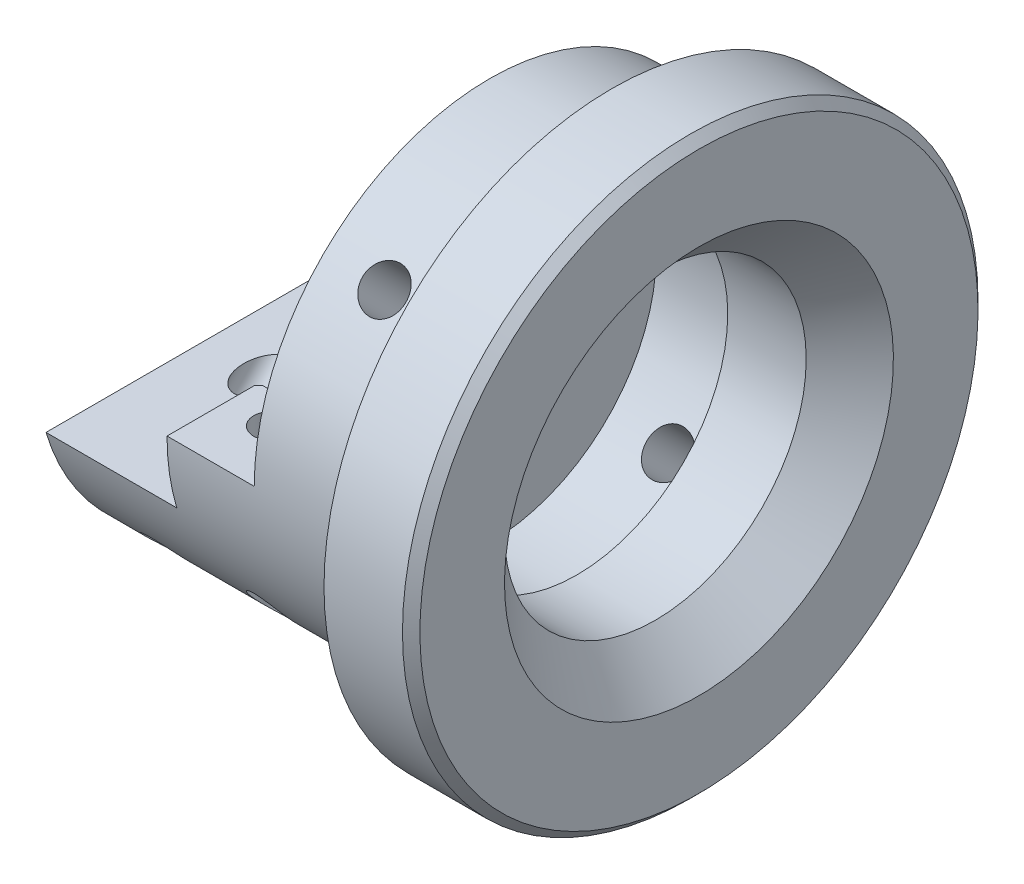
ISO-10303-21;
HEADER;
FILE_DESCRIPTION(('STEP AP214'),'2;1');
FILE_NAME('part.step','',(''),(''),'','','');
FILE_SCHEMA(('AUTOMOTIVE_DESIGN { 1 0 10303 214 1 1 1 1 }'));
ENDSEC;
DATA;
#1=APPLICATION_CONTEXT('core data for automotive mechanical design processes');
#2=APPLICATION_PROTOCOL_DEFINITION('international standard','automotive_design',2000,#1);
#3=PRODUCT_CONTEXT('',#1,'mechanical');
#4=PRODUCT('Part','Part','',(#3));
#5=PRODUCT_RELATED_PRODUCT_CATEGORY('part','',(#4));
#6=PRODUCT_DEFINITION_FORMATION('','',#4);
#7=PRODUCT_DEFINITION_CONTEXT('part definition',#1,'design');
#8=PRODUCT_DEFINITION('design','',#6,#7);
#9=PRODUCT_DEFINITION_SHAPE('','',#8);
#10=(LENGTH_UNIT() NAMED_UNIT(*) SI_UNIT(.MILLI.,.METRE.));
#11=(NAMED_UNIT(*) PLANE_ANGLE_UNIT() SI_UNIT($,.RADIAN.));
#12=(NAMED_UNIT(*) SI_UNIT($,.STERADIAN.) SOLID_ANGLE_UNIT());
#13=UNCERTAINTY_MEASURE_WITH_UNIT(LENGTH_MEASURE(1.E-05),#10,'distance_accuracy_value','');
#14=(GEOMETRIC_REPRESENTATION_CONTEXT(3) GLOBAL_UNCERTAINTY_ASSIGNED_CONTEXT((#13)) GLOBAL_UNIT_ASSIGNED_CONTEXT((#10,
#11,#12)) REPRESENTATION_CONTEXT('',''));
#15=CARTESIAN_POINT('',(0.,0.,0.));
#16=DIRECTION('',(0.,0.,1.));
#17=DIRECTION('',(1.,0.,0.));
#18=AXIS2_PLACEMENT_3D('',#15,#16,#17);
#19=CARTESIAN_POINT('',(132.700000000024,0.,-25.));
#20=DIRECTION('',(0.,-1.,0.));
#21=DIRECTION('',(1.,0.,0.));
#22=AXIS2_PLACEMENT_3D('',#19,#20,#21);
#23=PLANE('',#22);
#24=DIRECTION('',(0.,0.,1.));
#25=VECTOR('',#24,1.);
#26=CARTESIAN_POINT('',(132.700000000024,0.,-25.));
#27=LINE('',#26,#25);
#28=CARTESIAN_POINT('',(132.700000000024,0.,4.60977222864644));
#29=VERTEX_POINT('',#28);
#30=CARTESIAN_POINT('',(132.700000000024,0.,4.99999999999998));
#31=VERTEX_POINT('',#30);
#32=EDGE_CURVE('E171',#29,#31,#27,.T.);
#33=ORIENTED_EDGE('',*,*,#32,.F.);
#34=DIRECTION('',(-1.,0.,0.));
#35=VECTOR('',#34,1.);
#36=CARTESIAN_POINT('',(144.700000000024,0.,4.60977222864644));
#37=LINE('',#36,#35);
#38=CARTESIAN_POINT('',(127.700000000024,0.,4.60977222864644));
#39=VERTEX_POINT('',#38);
#40=EDGE_CURVE('E160',#29,#39,#37,.T.);
#41=ORIENTED_EDGE('',*,*,#40,.T.);
#42=DIRECTION('',(0.,0.,1.));
#43=VECTOR('',#42,1.);
#44=CARTESIAN_POINT('',(127.700000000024,0.,-25.));
#45=LINE('',#44,#43);
#46=CARTESIAN_POINT('',(127.700000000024,0.,5.00000000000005));
#47=VERTEX_POINT('',#46);
#48=EDGE_CURVE('E168',#39,#47,#45,.T.);
#49=ORIENTED_EDGE('',*,*,#48,.T.);
#50=DIRECTION('',(0.707106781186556,0.,0.707106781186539));
#51=VECTOR('',#50,1.);
#52=CARTESIAN_POINT('',(129.450000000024,0.,6.75));
#53=LINE('',#52,#51);
#54=CARTESIAN_POINT('',(127.950000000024,0.,5.25));
#55=VERTEX_POINT('',#54);
#56=EDGE_CURVE('E335',#47,#55,#53,.T.);
#57=ORIENTED_EDGE('',*,*,#56,.T.);
#58=DIRECTION('',(-1.,0.,0.));
#59=VECTOR('',#58,1.);
#60=CARTESIAN_POINT('',(144.700000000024,0.,5.25));
#61=LINE('',#60,#59);
#62=CARTESIAN_POINT('',(132.450000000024,0.,5.25));
#63=VERTEX_POINT('',#62);
#64=EDGE_CURVE('E293',#55,#63,#61,.F.);
#65=ORIENTED_EDGE('',*,*,#64,.T.);
#66=DIRECTION('',(0.707106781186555,0.,-0.70710678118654));
#67=VECTOR('',#66,1.);
#68=CARTESIAN_POINT('',(130.950000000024,0.,6.75));
#69=LINE('',#68,#67);
#70=EDGE_CURVE('E333',#63,#31,#69,.T.);
#71=ORIENTED_EDGE('',*,*,#70,.T.);
#72=EDGE_LOOP('',(#33,#41,#49,#57,#65,#71));
#73=FACE_BOUND('',#72,.T.);
#74=ADVANCED_FACE('F48',(#73),#23,.F.);
#75=CARTESIAN_POINT('',(130.200000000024,0.,10.));
#76=DIRECTION('',(0.,1.,0.));
#77=DIRECTION('',(0.,0.,1.));
#78=AXIS2_PLACEMENT_3D('',#75,#76,#77);
#79=CIRCLE('',#78,1.025);
#80=CARTESIAN_POINT('',(130.200000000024,0.,11.025));
#81=VERTEX_POINT('',#80);
#82=EDGE_CURVE('E233',#81,#81,#79,.T.);
#83=ORIENTED_EDGE('',*,*,#82,.F.);
#84=EDGE_LOOP('',(#83));
#85=FACE_BOUND('',#84,.T.);
#86=CARTESIAN_POINT('',(132.700000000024,0.,8.50000000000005));
#87=VERTEX_POINT('',#86);
#88=CARTESIAN_POINT('',(132.700000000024,0.,9.55));
#89=VERTEX_POINT('',#88);
#90=EDGE_CURVE('E422',#87,#89,#27,.T.);
#91=ORIENTED_EDGE('',*,*,#90,.F.);
#92=DIRECTION('',(-0.707106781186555,0.,-0.70710678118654));
#93=VECTOR('',#92,1.);
#94=CARTESIAN_POINT('',(130.950000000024,0.,6.75));
#95=LINE('',#94,#93);
#96=CARTESIAN_POINT('',(132.450000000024,0.,8.25));
#97=VERTEX_POINT('',#96);
#98=EDGE_CURVE('E325',#87,#97,#95,.T.);
#99=ORIENTED_EDGE('',*,*,#98,.T.);
#100=DIRECTION('',(-1.,0.,0.));
#101=VECTOR('',#100,1.);
#102=CARTESIAN_POINT('',(144.700000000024,0.,8.25));
#103=LINE('',#102,#101);
#104=CARTESIAN_POINT('',(127.950000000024,0.,8.25));
#105=VERTEX_POINT('',#104);
#106=EDGE_CURVE('E290',#97,#105,#103,.T.);
#107=ORIENTED_EDGE('',*,*,#106,.T.);
#108=DIRECTION('',(-0.707106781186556,0.,0.707106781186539));
#109=VECTOR('',#108,1.);
#110=CARTESIAN_POINT('',(129.450000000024,0.,6.75));
#111=LINE('',#110,#109);
#112=CARTESIAN_POINT('',(127.700000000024,0.,8.49999999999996));
#113=VERTEX_POINT('',#112);
#114=EDGE_CURVE('E327',#105,#113,#111,.T.);
#115=ORIENTED_EDGE('',*,*,#114,.T.);
#116=CARTESIAN_POINT('',(127.700000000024,0.,13.5));
#117=VERTEX_POINT('',#116);
#118=EDGE_CURVE('E180',#113,#117,#45,.T.);
#119=ORIENTED_EDGE('',*,*,#118,.T.);
#120=DIRECTION('',(1.,0.,0.));
#121=VECTOR('',#120,1.);
#122=CARTESIAN_POINT('',(132.700000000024,0.,13.5));
#123=LINE('',#122,#121);
#124=CARTESIAN_POINT('',(132.700000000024,0.,13.5));
#125=VERTEX_POINT('',#124);
#126=EDGE_CURVE('E438',#117,#125,#123,.T.);
#127=ORIENTED_EDGE('',*,*,#126,.T.);
#128=EDGE_CURVE('E425',#89,#125,#27,.T.);
#129=ORIENTED_EDGE('',*,*,#128,.F.);
#130=EDGE_LOOP('',(#91,#99,#107,#115,#119,#127,#129));
#131=FACE_BOUND('',#130,.T.);
#132=ADVANCED_FACE('F386',(#85,#131),#23,.F.);
#133=CARTESIAN_POINT('',(127.700000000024,0.,-5.00000000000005));
#134=VERTEX_POINT('',#133);
#135=CARTESIAN_POINT('',(127.700000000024,0.,-4.60977222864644));
#136=VERTEX_POINT('',#135);
#137=EDGE_CURVE('E179',#134,#136,#45,.T.);
#138=ORIENTED_EDGE('',*,*,#137,.T.);
#139=DIRECTION('',(-1.,0.,0.));
#140=VECTOR('',#139,1.);
#141=CARTESIAN_POINT('',(144.700000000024,0.,-4.60977222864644));
#142=LINE('',#141,#140);
#143=CARTESIAN_POINT('',(132.700000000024,0.,-4.60977222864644));
#144=VERTEX_POINT('',#143);
#145=EDGE_CURVE('E63',#136,#144,#142,.F.);
#146=ORIENTED_EDGE('',*,*,#145,.T.);
#147=CARTESIAN_POINT('',(132.700000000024,0.,-4.99999999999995));
#148=VERTEX_POINT('',#147);
#149=EDGE_CURVE('E419',#148,#144,#27,.T.);
#150=ORIENTED_EDGE('',*,*,#149,.F.);
#151=DIRECTION('',(-0.707106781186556,0.,-0.707106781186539));
#152=VECTOR('',#151,1.);
#153=CARTESIAN_POINT('',(130.950000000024,0.,-6.75));
#154=LINE('',#153,#152);
#155=CARTESIAN_POINT('',(132.450000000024,0.,-5.25));
#156=VERTEX_POINT('',#155);
#157=EDGE_CURVE('E337',#148,#156,#154,.T.);
#158=ORIENTED_EDGE('',*,*,#157,.T.);
#159=DIRECTION('',(-1.,0.,0.));
#160=VECTOR('',#159,1.);
#161=CARTESIAN_POINT('',(144.700000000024,0.,-5.25));
#162=LINE('',#161,#160);
#163=CARTESIAN_POINT('',(127.950000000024,0.,-5.25));
#164=VERTEX_POINT('',#163);
#165=EDGE_CURVE('E283',#156,#164,#162,.T.);
#166=ORIENTED_EDGE('',*,*,#165,.T.);
#167=DIRECTION('',(-0.707106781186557,0.,0.707106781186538));
#168=VECTOR('',#167,1.);
#169=CARTESIAN_POINT('',(129.450000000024,0.,-6.75));
#170=LINE('',#169,#168);
#171=EDGE_CURVE('E339',#164,#134,#170,.T.);
#172=ORIENTED_EDGE('',*,*,#171,.T.);
#173=EDGE_LOOP('',(#138,#146,#150,#158,#166,#172));
#174=FACE_BOUND('',#173,.T.);
#175=ADVANCED_FACE('F390',(#174),#23,.F.);
#176=CARTESIAN_POINT('',(132.700000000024,8.65,0.));
#177=DIRECTION('',(1.,0.,0.));
#178=DIRECTION('',(0.,1.,0.));
#179=AXIS2_PLACEMENT_3D('',#176,#177,#178);
#180=PLANE('',#179);
#181=CARTESIAN_POINT('',(132.700000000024,3.,0.));
#182=DIRECTION('',(1.,0.,0.));
#183=DIRECTION('',(0.,1.,0.));
#184=AXIS2_PLACEMENT_3D('',#181,#182,#183);
#185=CIRCLE('',#184,5.5);
#186=EDGE_CURVE('E172',#29,#144,#185,.T.);
#187=ORIENTED_EDGE('',*,*,#186,.F.);
#188=ORIENTED_EDGE('',*,*,#32,.T.);
#189=CARTESIAN_POINT('',(132.700000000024,0.,6.75));
#190=DIRECTION('',(1.,0.,0.));
#191=DIRECTION('',(0.,1.,0.));
#192=AXIS2_PLACEMENT_3D('',#189,#190,#191);
#193=CIRCLE('',#192,1.75000000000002);
#194=EDGE_CURVE('E329',#31,#87,#193,.F.);
#195=ORIENTED_EDGE('',*,*,#194,.T.);
#196=ORIENTED_EDGE('',*,*,#90,.T.);
#197=CARTESIAN_POINT('',(132.700000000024,0.,0.));
#198=DIRECTION('',(1.,0.,0.));
#199=DIRECTION('',(0.,1.,0.));
#200=AXIS2_PLACEMENT_3D('',#197,#198,#199);
#201=CIRCLE('',#200,9.55);
#202=CARTESIAN_POINT('',(132.700000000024,0.,-9.55));
#203=VERTEX_POINT('',#202);
#204=EDGE_CURVE('E447',#89,#203,#201,.T.);
#205=ORIENTED_EDGE('',*,*,#204,.T.);
#206=CARTESIAN_POINT('',(132.700000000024,0.,-8.50000000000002));
#207=VERTEX_POINT('',#206);
#208=EDGE_CURVE('E420',#203,#207,#27,.T.);
#209=ORIENTED_EDGE('',*,*,#208,.T.);
#210=CARTESIAN_POINT('',(132.700000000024,0.,-6.75));
#211=DIRECTION('',(1.,0.,0.));
#212=DIRECTION('',(0.,1.,0.));
#213=AXIS2_PLACEMENT_3D('',#210,#211,#212);
#214=CIRCLE('',#213,1.75000000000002);
#215=EDGE_CURVE('E331',#207,#148,#214,.F.);
#216=ORIENTED_EDGE('',*,*,#215,.T.);
#217=ORIENTED_EDGE('',*,*,#149,.T.);
#218=EDGE_LOOP('',(#187,#188,#195,#196,#205,#209,#216,#217));
#219=FACE_BOUND('',#218,.T.);
#220=ADVANCED_FACE('F403',(#219),#180,.T.);
#221=CARTESIAN_POINT('',(139.700000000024,16.5,0.));
#222=DIRECTION('',(-1.,0.,0.));
#223=DIRECTION('',(0.,-1.,0.));
#224=AXIS2_PLACEMENT_3D('',#221,#222,#223);
#225=PLANE('',#224);
#226=CARTESIAN_POINT('',(139.700000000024,0.,0.));
#227=DIRECTION('',(1.,0.,0.));
#228=DIRECTION('',(0.,1.,0.));
#229=AXIS2_PLACEMENT_3D('',#226,#227,#228);
#230=CIRCLE('',#229,13.5);
#231=CARTESIAN_POINT('',(139.700000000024,13.5,0.));
#232=VERTEX_POINT('',#231);
#233=EDGE_CURVE('E456',#232,#232,#230,.T.);
#234=ORIENTED_EDGE('',*,*,#233,.T.);
#235=EDGE_LOOP('',(#234));
#236=FACE_BOUND('',#235,.T.);
#237=CARTESIAN_POINT('',(139.700000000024,0.,0.));
#238=DIRECTION('',(1.,0.,0.));
#239=DIRECTION('',(0.,1.,0.));
#240=AXIS2_PLACEMENT_3D('',#237,#238,#239);
#241=CIRCLE('',#240,16.5);
#242=CARTESIAN_POINT('',(139.700000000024,16.5,0.));
#243=VERTEX_POINT('',#242);
#244=EDGE_CURVE('E453',#243,#243,#241,.T.);
#245=ORIENTED_EDGE('',*,*,#244,.F.);
#246=EDGE_LOOP('',(#245));
#247=FACE_BOUND('',#246,.T.);
#248=ADVANCED_FACE('F408',(#236,#247),#225,.T.);
#249=CARTESIAN_POINT('',(132.700000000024,0.,0.));
#250=DIRECTION('',(1.,0.,0.));
#251=DIRECTION('',(0.,1.,0.));
#252=AXIS2_PLACEMENT_3D('',#249,#250,#251);
#253=CYLINDRICAL_SURFACE('',#252,13.5);
#254=CARTESIAN_POINT('',(136.200000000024,-8.62104945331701,-10.3888164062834));
#255=CARTESIAN_POINT('',(136.270051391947,-8.62105214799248,-10.388814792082));
#256=CARTESIAN_POINT('',(136.340149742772,-8.62561874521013,-10.3850298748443));
#257=CARTESIAN_POINT('',(136.478404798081,-8.64373532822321,-10.3699553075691));
#258=CARTESIAN_POINT('',(136.546559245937,-8.65729534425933,-10.3586572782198));
#259=CARTESIAN_POINT('',(136.678904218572,-8.69290571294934,-10.3287911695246));
#260=CARTESIAN_POINT('',(136.743097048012,-8.71495107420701,-10.3102273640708));
#261=CARTESIAN_POINT('',(136.865737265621,-8.76675057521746,-10.2662180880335));
#262=CARTESIAN_POINT('',(136.924185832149,-8.79650312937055,-10.2407740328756));
#263=CARTESIAN_POINT('',(137.033876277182,-8.86279167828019,-10.1834592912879));
#264=CARTESIAN_POINT('',(137.085097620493,-8.89934634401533,-10.1515708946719));
#265=CARTESIAN_POINT('',(137.178702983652,-8.97796171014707,-10.0821103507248));
#266=CARTESIAN_POINT('',(137.221086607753,-9.02002265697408,-10.0445379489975));
#267=CARTESIAN_POINT('',(137.295883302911,-9.10836012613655,-9.96450344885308));
#268=CARTESIAN_POINT('',(137.328278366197,-9.1546440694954,-9.92203270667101));
#269=CARTESIAN_POINT('',(137.382063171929,-9.2498919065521,-9.83329709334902));
#270=CARTESIAN_POINT('',(137.403453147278,-9.29885574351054,-9.78703230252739));
#271=CARTESIAN_POINT('',(137.434560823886,-9.39781050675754,-9.69205061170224));
#272=CARTESIAN_POINT('',(137.444312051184,-9.44779805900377,-9.64334117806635));
#273=CARTESIAN_POINT('',(137.451969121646,-9.54745628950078,-9.54468405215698));
#274=CARTESIAN_POINT('',(137.449875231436,-9.59712697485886,-9.49473638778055));
#275=CARTESIAN_POINT('',(137.433928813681,-9.69459401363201,-9.39519482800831));
#276=CARTESIAN_POINT('',(137.420112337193,-9.74239564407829,-9.34560031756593));
#277=CARTESIAN_POINT('',(137.381169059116,-9.83500814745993,-9.24808841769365));
#278=CARTESIAN_POINT('',(137.356042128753,-9.87981898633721,-9.2001710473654));
#279=CARTESIAN_POINT('',(137.295151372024,-9.96538518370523,-9.10741949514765));
#280=CARTESIAN_POINT('',(137.259371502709,-10.006134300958,-9.06259008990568));
#281=CARTESIAN_POINT('',(137.178202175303,-10.0825313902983,-8.97751830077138));
#282=CARTESIAN_POINT('',(137.132812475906,-10.118179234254,-8.93727603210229));
#283=CARTESIAN_POINT('',(137.033508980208,-10.183693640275,-8.86255424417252));
#284=CARTESIAN_POINT('',(136.979563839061,-10.2135380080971,-8.828096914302));
#285=CARTESIAN_POINT('',(136.864789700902,-10.266629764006,-8.76629787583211));
#286=CARTESIAN_POINT('',(136.80396069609,-10.2898771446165,-8.73895617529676));
#287=CARTESIAN_POINT('',(136.677122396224,-10.3292879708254,-8.69233838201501));
#288=CARTESIAN_POINT('',(136.611112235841,-10.3454502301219,-8.67306363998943));
#289=CARTESIAN_POINT('',(136.475796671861,-10.3703486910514,-8.64327763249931));
#290=CARTESIAN_POINT('',(136.406491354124,-10.3790850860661,-8.63276613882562));
#291=CARTESIAN_POINT('',(136.266827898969,-10.3889337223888,-8.6209115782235));
#292=CARTESIAN_POINT('',(136.196474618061,-10.3900741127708,-8.6195346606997));
#293=CARTESIAN_POINT('',(136.056470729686,-10.384782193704,-8.62590953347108));
#294=CARTESIAN_POINT('',(135.98682011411,-10.3783499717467,-8.6336612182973));
#295=CARTESIAN_POINT('',(135.85032556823,-10.3580631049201,-8.6579891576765));
#296=CARTESIAN_POINT('',(135.783476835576,-10.3442217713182,-8.6745495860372));
#297=CARTESIAN_POINT('',(135.654334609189,-10.3094088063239,-8.71589445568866));
#298=CARTESIAN_POINT('',(135.592041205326,-10.2884370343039,-8.7406790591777));
#299=CARTESIAN_POINT('',(135.473577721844,-10.2397266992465,-8.79769297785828));
#300=CARTESIAN_POINT('',(135.417426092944,-10.2119685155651,-8.82994386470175));
#301=CARTESIAN_POINT('',(135.31302690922,-10.1503103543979,-8.9007526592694));
#302=CARTESIAN_POINT('',(135.264779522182,-10.1164102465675,-8.939310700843));
#303=CARTESIAN_POINT('',(135.177407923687,-10.0431085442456,-9.0215857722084));
#304=CARTESIAN_POINT('',(135.138312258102,-10.0036903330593,-9.06531832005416));
#305=CARTESIAN_POINT('',(135.070550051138,-9.92036126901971,-9.15643153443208));
#306=CARTESIAN_POINT('',(135.041883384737,-9.8764504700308,-9.2038121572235));
#307=CARTESIAN_POINT('',(134.995841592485,-9.78530529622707,-9.30065649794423));
#308=CARTESIAN_POINT('',(134.978449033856,-9.73807617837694,-9.35011687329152));
#309=CARTESIAN_POINT('',(134.955392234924,-9.64148634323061,-9.44968515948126));
#310=CARTESIAN_POINT('',(134.9497277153,-9.5921256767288,-9.49979305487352));
#311=CARTESIAN_POINT('',(134.950291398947,-9.49284101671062,-9.59900393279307));
#312=CARTESIAN_POINT('',(134.956475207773,-9.44291982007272,-9.64810997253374));
#313=CARTESIAN_POINT('',(134.980467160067,-9.34378586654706,-9.74414852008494));
#314=CARTESIAN_POINT('',(134.998275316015,-9.29457311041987,-9.79108102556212));
#315=CARTESIAN_POINT('',(135.04499861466,-9.19834766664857,-9.88153652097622));
#316=CARTESIAN_POINT('',(135.073912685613,-9.15133476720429,-9.92505983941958));
#317=CARTESIAN_POINT('',(135.14202218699,-9.06096865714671,-10.0076269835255));
#318=CARTESIAN_POINT('',(135.18121750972,-9.01761540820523,-10.0466708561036));
#319=CARTESIAN_POINT('',(135.268943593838,-8.93580920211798,-10.1195024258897));
#320=CARTESIAN_POINT('',(135.317507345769,-8.89737438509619,-10.1532707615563));
#321=CARTESIAN_POINT('',(135.422528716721,-8.82685492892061,-10.2146377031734));
#322=CARTESIAN_POINT('',(135.478988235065,-8.7947718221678,-10.2422348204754));
#323=CARTESIAN_POINT('',(135.598333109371,-8.73800077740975,-10.2907115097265));
#324=CARTESIAN_POINT('',(135.661232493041,-8.71332946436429,-10.3115759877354));
#325=CARTESIAN_POINT('',(135.79152848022,-8.67237146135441,-10.3460473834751));
#326=CARTESIAN_POINT('',(135.858919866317,-8.65607522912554,-10.3596625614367));
#327=CARTESIAN_POINT('',(135.972250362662,-8.6365516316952,-10.3759370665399));
#328=CARTESIAN_POINT('',(136.017462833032,-8.63074778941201,-10.380761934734));
#329=CARTESIAN_POINT('',(136.108443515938,-8.62299582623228,-10.3872021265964));
#330=CARTESIAN_POINT('',(136.154211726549,-8.62104769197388,-10.3888174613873));
#331=CARTESIAN_POINT('',(136.200000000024,-8.62104945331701,-10.3888164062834));
#332=B_SPLINE_CURVE_WITH_KNOTS('',3,(#254,#255,#256,#257,#258,#259,#260,#261,#262,#263,#264,
#265,#266,#267,#268,#269,#270,#271,#272,#273,#274,#275,#276,#277,#278,#279,#280,#281,#282,#283,
#284,#285,#286,#287,#288,#289,#290,#291,#292,#293,#294,#295,#296,#297,#298,#299,#300,#301,#302,
#303,#304,#305,#306,#307,#308,#309,#310,#311,#312,#313,#314,#315,#316,#317,#318,#319,#320,#321,
#322,#323,#324,#325,#326,#327,#328,#329,#330,#331),.UNSPECIFIED.,.T.,.F.,(4,2,2,2,2,2,2,2,2,2,2,
2,2,2,2,2,2,2,2,2,2,2,2,2,2,2,2,2,2,2,2,2,2,2,2,2,2,2,4),(0.,0.2099869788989,0.420208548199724,
0.630306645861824,0.840361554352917,1.05100177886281,1.26165143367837,1.47267866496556,
1.68370143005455,1.89411485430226,2.10452354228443,2.3142874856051,2.52405381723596,
2.7341376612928,2.94422678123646,3.15510419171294,3.3659818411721,3.57689478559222,
3.78780223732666,3.99792767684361,4.20805068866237,4.4177974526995,4.62754835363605,
4.8379130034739,5.04828211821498,5.25929891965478,5.47031319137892,5.68100039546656,
5.89168258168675,6.10157690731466,6.31147145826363,6.52134575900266,6.73121786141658,
6.9418429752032,7.15251884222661,7.36366379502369,7.57456764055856,7.71182365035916,
7.84907918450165),.UNSPECIFIED.);
#333=CARTESIAN_POINT('',(136.200000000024,-8.62104945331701,-10.3888164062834));
#334=VERTEX_POINT('',#333);
#335=EDGE_CURVE('E56',#334,#334,#332,.T.);
#336=ORIENTED_EDGE('',*,*,#335,.F.);
#337=EDGE_LOOP('',(#336));
#338=FACE_BOUND('',#337,.T.);
#339=CARTESIAN_POINT('',(123.700000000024,-10.3888164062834,8.62104945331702));
#340=CARTESIAN_POINT('',(123.770051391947,-10.388814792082,8.62105214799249));
#341=CARTESIAN_POINT('',(123.840149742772,-10.3850298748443,8.62561874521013));
#342=CARTESIAN_POINT('',(123.978404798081,-10.3699553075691,8.64373532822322));
#343=CARTESIAN_POINT('',(124.046559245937,-10.3586572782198,8.65729534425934));
#344=CARTESIAN_POINT('',(124.178904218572,-10.3287911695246,8.69290571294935));
#345=CARTESIAN_POINT('',(124.243097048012,-10.3102273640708,8.71495107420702));
#346=CARTESIAN_POINT('',(124.365737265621,-10.2662180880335,8.76675057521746));
#347=CARTESIAN_POINT('',(124.424185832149,-10.2407740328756,8.79650312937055));
#348=CARTESIAN_POINT('',(124.533876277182,-10.1834592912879,8.86279167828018));
#349=CARTESIAN_POINT('',(124.585097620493,-10.151570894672,8.89934634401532));
#350=CARTESIAN_POINT('',(124.678702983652,-10.0821103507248,8.97796171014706));
#351=CARTESIAN_POINT('',(124.721086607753,-10.0445379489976,9.02002265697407));
#352=CARTESIAN_POINT('',(124.795883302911,-9.96450344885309,9.10836012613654));
#353=CARTESIAN_POINT('',(124.828278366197,-9.92203270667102,9.15464406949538));
#354=CARTESIAN_POINT('',(124.882063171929,-9.83329709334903,9.24989190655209));
#355=CARTESIAN_POINT('',(124.903453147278,-9.7870323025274,9.29885574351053));
#356=CARTESIAN_POINT('',(124.934560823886,-9.69205061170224,9.39781050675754));
#357=CARTESIAN_POINT('',(124.944312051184,-9.64334117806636,9.44779805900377));
#358=CARTESIAN_POINT('',(124.951969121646,-9.544684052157,9.54745628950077));
#359=CARTESIAN_POINT('',(124.949875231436,-9.49473638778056,9.59712697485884));
#360=CARTESIAN_POINT('',(124.933928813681,-9.39519482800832,9.694594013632));
#361=CARTESIAN_POINT('',(124.920112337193,-9.34560031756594,9.74239564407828));
#362=CARTESIAN_POINT('',(124.881169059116,-9.24808841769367,9.83500814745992));
#363=CARTESIAN_POINT('',(124.856042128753,-9.20017104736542,9.8798189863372));
#364=CARTESIAN_POINT('',(124.795151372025,-9.10741949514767,9.96538518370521));
#365=CARTESIAN_POINT('',(124.759371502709,-9.0625900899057,10.006134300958));
#366=CARTESIAN_POINT('',(124.678202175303,-8.97751830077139,10.0825313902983));
#367=CARTESIAN_POINT('',(124.632812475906,-8.93727603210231,10.118179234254));
#368=CARTESIAN_POINT('',(124.533508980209,-8.86255424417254,10.183693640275));
#369=CARTESIAN_POINT('',(124.479563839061,-8.82809691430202,10.2135380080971));
#370=CARTESIAN_POINT('',(124.364789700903,-8.76629787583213,10.266629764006));
#371=CARTESIAN_POINT('',(124.30396069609,-8.73895617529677,10.2898771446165));
#372=CARTESIAN_POINT('',(124.177122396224,-8.69233838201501,10.3292879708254));
#373=CARTESIAN_POINT('',(124.111112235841,-8.67306363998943,10.3454502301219));
#374=CARTESIAN_POINT('',(123.975796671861,-8.64327763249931,10.3703486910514));
#375=CARTESIAN_POINT('',(123.906491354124,-8.63276613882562,10.3790850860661));
#376=CARTESIAN_POINT('',(123.766827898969,-8.6209115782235,10.3889337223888));
#377=CARTESIAN_POINT('',(123.696474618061,-8.61953466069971,10.3900741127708));
#378=CARTESIAN_POINT('',(123.556470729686,-8.62590953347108,10.384782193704));
#379=CARTESIAN_POINT('',(123.48682011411,-8.6336612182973,10.3783499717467));
#380=CARTESIAN_POINT('',(123.350325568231,-8.6579891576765,10.3580631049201));
#381=CARTESIAN_POINT('',(123.283476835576,-8.6745495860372,10.3442217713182));
#382=CARTESIAN_POINT('',(123.154334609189,-8.71589445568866,10.3094088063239));
#383=CARTESIAN_POINT('',(123.092041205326,-8.7406790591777,10.2884370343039));
#384=CARTESIAN_POINT('',(122.973577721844,-8.79769297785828,10.2397266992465));
#385=CARTESIAN_POINT('',(122.917426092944,-8.82994386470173,10.2119685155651));
#386=CARTESIAN_POINT('',(122.81302690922,-8.90075265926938,10.1503103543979));
#387=CARTESIAN_POINT('',(122.764779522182,-8.93931070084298,10.1164102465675));
#388=CARTESIAN_POINT('',(122.677407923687,-9.02158577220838,10.0431085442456));
#389=CARTESIAN_POINT('',(122.638312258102,-9.06531832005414,10.0036903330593));
#390=CARTESIAN_POINT('',(122.570550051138,-9.15643153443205,9.92036126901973));
#391=CARTESIAN_POINT('',(122.541883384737,-9.20381215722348,9.87645047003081));
#392=CARTESIAN_POINT('',(122.495841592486,-9.30065649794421,9.78530529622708));
#393=CARTESIAN_POINT('',(122.478449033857,-9.3501168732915,9.73807617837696));
#394=CARTESIAN_POINT('',(122.455392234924,-9.44968515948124,9.64148634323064));
#395=CARTESIAN_POINT('',(122.4497277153,-9.4997930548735,9.59212567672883));
#396=CARTESIAN_POINT('',(122.450291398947,-9.59900393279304,9.49284101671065));
#397=CARTESIAN_POINT('',(122.456475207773,-9.64810997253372,9.44291982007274));
#398=CARTESIAN_POINT('',(122.480467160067,-9.74414852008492,9.34378586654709));
#399=CARTESIAN_POINT('',(122.498275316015,-9.79108102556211,9.2945731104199));
#400=CARTESIAN_POINT('',(122.54499861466,-9.8815365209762,9.19834766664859));
#401=CARTESIAN_POINT('',(122.573912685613,-9.92505983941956,9.15133476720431));
#402=CARTESIAN_POINT('',(122.64202218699,-10.0076269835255,9.06096865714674));
#403=CARTESIAN_POINT('',(122.68121750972,-10.0466708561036,9.01761540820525));
#404=CARTESIAN_POINT('',(122.768943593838,-10.1195024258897,8.935809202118));
#405=CARTESIAN_POINT('',(122.817507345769,-10.1532707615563,8.89737438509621));
#406=CARTESIAN_POINT('',(122.922528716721,-10.2146377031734,8.82685492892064));
#407=CARTESIAN_POINT('',(122.978988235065,-10.2422348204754,8.79477182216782));
#408=CARTESIAN_POINT('',(123.098333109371,-10.2907115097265,8.73800077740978));
#409=CARTESIAN_POINT('',(123.161232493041,-10.3115759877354,8.71332946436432));
#410=CARTESIAN_POINT('',(123.29152848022,-10.3460473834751,8.67237146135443));
#411=CARTESIAN_POINT('',(123.358919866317,-10.3596625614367,8.65607522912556));
#412=CARTESIAN_POINT('',(123.472250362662,-10.3759370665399,8.63655163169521));
#413=CARTESIAN_POINT('',(123.517462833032,-10.380761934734,8.63074778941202));
#414=CARTESIAN_POINT('',(123.608443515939,-10.3872021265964,8.62299582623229));
#415=CARTESIAN_POINT('',(123.654211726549,-10.3888174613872,8.62104769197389));
#416=CARTESIAN_POINT('',(123.700000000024,-10.3888164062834,8.62104945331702));
#417=B_SPLINE_CURVE_WITH_KNOTS('',3,(#339,#340,#341,#342,#343,#344,#345,#346,#347,#348,#349,
#350,#351,#352,#353,#354,#355,#356,#357,#358,#359,#360,#361,#362,#363,#364,#365,#366,#367,#368,
#369,#370,#371,#372,#373,#374,#375,#376,#377,#378,#379,#380,#381,#382,#383,#384,#385,#386,#387,
#388,#389,#390,#391,#392,#393,#394,#395,#396,#397,#398,#399,#400,#401,#402,#403,#404,#405,#406,
#407,#408,#409,#410,#411,#412,#413,#414,#415,#416),.UNSPECIFIED.,.T.,.F.,(4,2,2,2,2,2,2,2,2,2,2,
2,2,2,2,2,2,2,2,2,2,2,2,2,2,2,2,2,2,2,2,2,2,2,2,2,2,2,4),(0.,0.209986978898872,
0.420208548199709,0.630306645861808,0.840361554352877,1.05100177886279,1.26165143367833,
1.47267866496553,1.68370143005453,1.89411485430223,2.1045235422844,2.31428748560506,
2.52405381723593,2.73413766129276,2.94422678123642,3.15510419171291,3.36598184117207,
3.57689478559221,3.78780223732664,3.99792767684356,4.20805068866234,4.4177974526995,
4.62754835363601,4.83791300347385,5.04828211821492,5.25929891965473,5.47031319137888,
5.68100039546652,5.8916825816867,6.10157690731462,6.31147145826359,6.52134575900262,
6.73121786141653,6.94184297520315,7.15251884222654,7.36366379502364,7.57456764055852,
7.71182365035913,7.84907918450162),.UNSPECIFIED.);
#418=CARTESIAN_POINT('',(123.700000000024,-10.3888164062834,8.62104945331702));
#419=VERTEX_POINT('',#418);
#420=EDGE_CURVE('E539',#419,#419,#417,.T.);
#421=ORIENTED_EDGE('',*,*,#420,.F.);
#422=EDGE_LOOP('',(#421));
#423=FACE_BOUND('',#422,.T.);
#424=CARTESIAN_POINT('',(123.700000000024,-8.62104945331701,-10.3888164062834));
#425=CARTESIAN_POINT('',(123.770051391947,-8.62105214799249,-10.388814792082));
#426=CARTESIAN_POINT('',(123.840149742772,-8.62561874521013,-10.3850298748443));
#427=CARTESIAN_POINT('',(123.978404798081,-8.64373532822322,-10.3699553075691));
#428=CARTESIAN_POINT('',(124.046559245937,-8.65729534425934,-10.3586572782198));
#429=CARTESIAN_POINT('',(124.178904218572,-8.69290571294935,-10.3287911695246));
#430=CARTESIAN_POINT('',(124.243097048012,-8.71495107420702,-10.3102273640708));
#431=CARTESIAN_POINT('',(124.365737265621,-8.76675057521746,-10.2662180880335));
#432=CARTESIAN_POINT('',(124.424185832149,-8.79650312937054,-10.2407740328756));
#433=CARTESIAN_POINT('',(124.533876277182,-8.86279167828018,-10.1834592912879));
#434=CARTESIAN_POINT('',(124.585097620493,-8.89934634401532,-10.151570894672));
#435=CARTESIAN_POINT('',(124.678702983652,-8.97796171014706,-10.0821103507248));
#436=CARTESIAN_POINT('',(124.721086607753,-9.02002265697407,-10.0445379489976));
#437=CARTESIAN_POINT('',(124.795883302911,-9.10836012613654,-9.96450344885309));
#438=CARTESIAN_POINT('',(124.828278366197,-9.15464406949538,-9.92203270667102));
#439=CARTESIAN_POINT('',(124.882063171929,-9.24989190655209,-9.83329709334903));
#440=CARTESIAN_POINT('',(124.903453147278,-9.29885574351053,-9.7870323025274));
#441=CARTESIAN_POINT('',(124.934560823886,-9.39781050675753,-9.69205061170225));
#442=CARTESIAN_POINT('',(124.944312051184,-9.44779805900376,-9.64334117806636));
#443=CARTESIAN_POINT('',(124.951969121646,-9.54745628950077,-9.544684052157));
#444=CARTESIAN_POINT('',(124.949875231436,-9.59712697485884,-9.49473638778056));
#445=CARTESIAN_POINT('',(124.933928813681,-9.694594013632,-9.39519482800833));
#446=CARTESIAN_POINT('',(124.920112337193,-9.74239564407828,-9.34560031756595));
#447=CARTESIAN_POINT('',(124.881169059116,-9.83500814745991,-9.24808841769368));
#448=CARTESIAN_POINT('',(124.856042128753,-9.8798189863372,-9.20017104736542));
#449=CARTESIAN_POINT('',(124.795151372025,-9.96538518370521,-9.10741949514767));
#450=CARTESIAN_POINT('',(124.759371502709,-10.0061343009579,-9.0625900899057));
#451=CARTESIAN_POINT('',(124.678202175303,-10.0825313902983,-8.97751830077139));
#452=CARTESIAN_POINT('',(124.632812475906,-10.118179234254,-8.93727603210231));
#453=CARTESIAN_POINT('',(124.533508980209,-10.183693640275,-8.86255424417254));
#454=CARTESIAN_POINT('',(124.479563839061,-10.2135380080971,-8.82809691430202));
#455=CARTESIAN_POINT('',(124.364789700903,-10.266629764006,-8.76629787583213));
#456=CARTESIAN_POINT('',(124.30396069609,-10.2898771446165,-8.73895617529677));
#457=CARTESIAN_POINT('',(124.177122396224,-10.3292879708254,-8.69233838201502));
#458=CARTESIAN_POINT('',(124.111112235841,-10.3454502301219,-8.67306363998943));
#459=CARTESIAN_POINT('',(123.975796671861,-10.3703486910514,-8.64327763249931));
#460=CARTESIAN_POINT('',(123.906491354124,-10.3790850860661,-8.63276613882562));
#461=CARTESIAN_POINT('',(123.766827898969,-10.3889337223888,-8.6209115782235));
#462=CARTESIAN_POINT('',(123.696474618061,-10.3900741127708,-8.61953466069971));
#463=CARTESIAN_POINT('',(123.556470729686,-10.384782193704,-8.62590953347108));
#464=CARTESIAN_POINT('',(123.48682011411,-10.3783499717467,-8.6336612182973));
#465=CARTESIAN_POINT('',(123.350325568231,-10.3580631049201,-8.6579891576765));
#466=CARTESIAN_POINT('',(123.283476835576,-10.3442217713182,-8.6745495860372));
#467=CARTESIAN_POINT('',(123.154334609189,-10.3094088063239,-8.71589445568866));
#468=CARTESIAN_POINT('',(123.092041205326,-10.2884370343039,-8.7406790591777));
#469=CARTESIAN_POINT('',(122.973577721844,-10.2397266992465,-8.79769297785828));
#470=CARTESIAN_POINT('',(122.917426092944,-10.2119685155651,-8.82994386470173));
#471=CARTESIAN_POINT('',(122.81302690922,-10.1503103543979,-8.90075265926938));
#472=CARTESIAN_POINT('',(122.764779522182,-10.1164102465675,-8.93931070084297));
#473=CARTESIAN_POINT('',(122.677407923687,-10.0431085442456,-9.02158577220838));
#474=CARTESIAN_POINT('',(122.638312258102,-10.0036903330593,-9.06531832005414));
#475=CARTESIAN_POINT('',(122.570550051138,-9.92036126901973,-9.15643153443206));
#476=CARTESIAN_POINT('',(122.541883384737,-9.87645047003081,-9.20381215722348));
#477=CARTESIAN_POINT('',(122.495841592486,-9.78530529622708,-9.30065649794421));
#478=CARTESIAN_POINT('',(122.478449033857,-9.73807617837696,-9.3501168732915));
#479=CARTESIAN_POINT('',(122.455392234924,-9.64148634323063,-9.44968515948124));
#480=CARTESIAN_POINT('',(122.4497277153,-9.59212567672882,-9.4997930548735));
#481=CARTESIAN_POINT('',(122.450291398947,-9.49284101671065,-9.59900393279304));
#482=CARTESIAN_POINT('',(122.456475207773,-9.44291982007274,-9.64810997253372));
#483=CARTESIAN_POINT('',(122.480467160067,-9.34378586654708,-9.74414852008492));
#484=CARTESIAN_POINT('',(122.498275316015,-9.29457311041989,-9.79108102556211));
#485=CARTESIAN_POINT('',(122.54499861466,-9.19834766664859,-9.8815365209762));
#486=CARTESIAN_POINT('',(122.573912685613,-9.15133476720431,-9.92505983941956));
#487=CARTESIAN_POINT('',(122.64202218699,-9.06096865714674,-10.0076269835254));
#488=CARTESIAN_POINT('',(122.68121750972,-9.01761540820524,-10.0466708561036));
#489=CARTESIAN_POINT('',(122.768943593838,-8.935809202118,-10.1195024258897));
#490=CARTESIAN_POINT('',(122.817507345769,-8.89737438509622,-10.1532707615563));
#491=CARTESIAN_POINT('',(122.922528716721,-8.82685492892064,-10.2146377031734));
#492=CARTESIAN_POINT('',(122.978988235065,-8.79477182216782,-10.2422348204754));
#493=CARTESIAN_POINT('',(123.098333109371,-8.73800077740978,-10.2907115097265));
#494=CARTESIAN_POINT('',(123.161232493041,-8.71332946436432,-10.3115759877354));
#495=CARTESIAN_POINT('',(123.29152848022,-8.67237146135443,-10.3460473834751));
#496=CARTESIAN_POINT('',(123.358919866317,-8.65607522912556,-10.3596625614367));
#497=CARTESIAN_POINT('',(123.472250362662,-8.63655163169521,-10.3759370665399));
#498=CARTESIAN_POINT('',(123.517462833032,-8.63074778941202,-10.380761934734));
#499=CARTESIAN_POINT('',(123.608443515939,-8.62299582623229,-10.3872021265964));
#500=CARTESIAN_POINT('',(123.654211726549,-8.62104769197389,-10.3888174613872));
#501=CARTESIAN_POINT('',(123.700000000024,-8.62104945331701,-10.3888164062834));
#502=B_SPLINE_CURVE_WITH_KNOTS('',3,(#424,#425,#426,#427,#428,#429,#430,#431,#432,#433,#434,
#435,#436,#437,#438,#439,#440,#441,#442,#443,#444,#445,#446,#447,#448,#449,#450,#451,#452,#453,
#454,#455,#456,#457,#458,#459,#460,#461,#462,#463,#464,#465,#466,#467,#468,#469,#470,#471,#472,
#473,#474,#475,#476,#477,#478,#479,#480,#481,#482,#483,#484,#485,#486,#487,#488,#489,#490,#491,
#492,#493,#494,#495,#496,#497,#498,#499,#500,#501),.UNSPECIFIED.,.T.,.F.,(4,2,2,2,2,2,2,2,2,2,2,
2,2,2,2,2,2,2,2,2,2,2,2,2,2,2,2,2,2,2,2,2,2,2,2,2,2,2,4),(0.,0.209986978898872,
0.420208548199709,0.630306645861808,0.840361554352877,1.05100177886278,1.26165143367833,
1.47267866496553,1.68370143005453,1.89411485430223,2.1045235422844,2.31428748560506,
2.52405381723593,2.73413766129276,2.94422678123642,3.15510419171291,3.36598184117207,
3.5768947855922,3.78780223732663,3.99792767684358,4.20805068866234,4.4177974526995,
4.62754835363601,4.83791300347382,5.04828211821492,5.25929891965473,5.47031319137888,
5.68100039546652,5.8916825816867,6.10157690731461,6.31147145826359,6.52134575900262,
6.73121786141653,6.94184297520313,7.15251884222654,7.36366379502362,7.57456764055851,
7.71182365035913,7.84907918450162),.UNSPECIFIED.);
#503=CARTESIAN_POINT('',(123.700000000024,-8.62104945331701,-10.3888164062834));
#504=VERTEX_POINT('',#503);
#505=EDGE_CURVE('E196',#504,#504,#502,.T.);
#506=ORIENTED_EDGE('',*,*,#505,.F.);
#507=EDGE_LOOP('',(#506));
#508=FACE_BOUND('',#507,.T.);
#509=CARTESIAN_POINT('',(136.200000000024,8.62104945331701,10.3888164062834));
#510=CARTESIAN_POINT('',(136.270051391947,8.62105214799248,10.388814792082));
#511=CARTESIAN_POINT('',(136.340149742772,8.62561874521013,10.3850298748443));
#512=CARTESIAN_POINT('',(136.478404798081,8.64373532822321,10.3699553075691));
#513=CARTESIAN_POINT('',(136.546559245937,8.65729534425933,10.3586572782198));
#514=CARTESIAN_POINT('',(136.678904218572,8.69290571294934,10.3287911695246));
#515=CARTESIAN_POINT('',(136.743097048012,8.71495107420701,10.3102273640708));
#516=CARTESIAN_POINT('',(136.865737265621,8.76675057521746,10.2662180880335));
#517=CARTESIAN_POINT('',(136.924185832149,8.79650312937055,10.2407740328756));
#518=CARTESIAN_POINT('',(137.033876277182,8.86279167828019,10.1834592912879));
#519=CARTESIAN_POINT('',(137.085097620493,8.89934634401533,10.1515708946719));
#520=CARTESIAN_POINT('',(137.178702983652,8.97796171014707,10.0821103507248));
#521=CARTESIAN_POINT('',(137.221086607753,9.02002265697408,10.0445379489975));
#522=CARTESIAN_POINT('',(137.295883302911,9.10836012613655,9.96450344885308));
#523=CARTESIAN_POINT('',(137.328278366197,9.15464406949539,9.92203270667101));
#524=CARTESIAN_POINT('',(137.382063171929,9.2498919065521,9.83329709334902));
#525=CARTESIAN_POINT('',(137.403453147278,9.29885574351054,9.78703230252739));
#526=CARTESIAN_POINT('',(137.434560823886,9.39781050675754,9.69205061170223));
#527=CARTESIAN_POINT('',(137.444312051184,9.44779805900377,9.64334117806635));
#528=CARTESIAN_POINT('',(137.451969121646,9.54745628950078,9.54468405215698));
#529=CARTESIAN_POINT('',(137.449875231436,9.59712697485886,9.49473638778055));
#530=CARTESIAN_POINT('',(137.433928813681,9.69459401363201,9.3951948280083));
#531=CARTESIAN_POINT('',(137.420112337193,9.74239564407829,9.34560031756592));
#532=CARTESIAN_POINT('',(137.381169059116,9.83500814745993,9.24808841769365));
#533=CARTESIAN_POINT('',(137.356042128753,9.87981898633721,9.20017104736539));
#534=CARTESIAN_POINT('',(137.295151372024,9.96538518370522,9.10741949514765));
#535=CARTESIAN_POINT('',(137.259371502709,10.006134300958,9.06259008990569));
#536=CARTESIAN_POINT('',(137.178202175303,10.0825313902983,8.97751830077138));
#537=CARTESIAN_POINT('',(137.132812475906,10.118179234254,8.93727603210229));
#538=CARTESIAN_POINT('',(137.033508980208,10.183693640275,8.86255424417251));
#539=CARTESIAN_POINT('',(136.979563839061,10.2135380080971,8.828096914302));
#540=CARTESIAN_POINT('',(136.864789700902,10.266629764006,8.76629787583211));
#541=CARTESIAN_POINT('',(136.80396069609,10.2898771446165,8.73895617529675));
#542=CARTESIAN_POINT('',(136.677122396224,10.3292879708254,8.69233838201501));
#543=CARTESIAN_POINT('',(136.611112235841,10.3454502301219,8.67306363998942));
#544=CARTESIAN_POINT('',(136.475796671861,10.3703486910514,8.64327763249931));
#545=CARTESIAN_POINT('',(136.406491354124,10.3790850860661,8.63276613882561));
#546=CARTESIAN_POINT('',(136.266827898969,10.3889337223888,8.6209115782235));
#547=CARTESIAN_POINT('',(136.196474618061,10.3900741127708,8.6195346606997));
#548=CARTESIAN_POINT('',(136.056470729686,10.384782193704,8.62590953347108));
#549=CARTESIAN_POINT('',(135.98682011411,10.3783499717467,8.6336612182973));
#550=CARTESIAN_POINT('',(135.85032556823,10.3580631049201,8.6579891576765));
#551=CARTESIAN_POINT('',(135.783476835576,10.3442217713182,8.6745495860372));
#552=CARTESIAN_POINT('',(135.654334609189,10.3094088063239,8.71589445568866));
#553=CARTESIAN_POINT('',(135.592041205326,10.2884370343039,8.7406790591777));
#554=CARTESIAN_POINT('',(135.473577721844,10.2397266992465,8.79769297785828));
#555=CARTESIAN_POINT('',(135.417426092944,10.2119685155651,8.82994386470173));
#556=CARTESIAN_POINT('',(135.31302690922,10.1503103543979,8.90075265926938));
#557=CARTESIAN_POINT('',(135.264779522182,10.1164102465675,8.93931070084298));
#558=CARTESIAN_POINT('',(135.177407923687,10.0431085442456,9.02158577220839));
#559=CARTESIAN_POINT('',(135.138312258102,10.0036903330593,9.06531832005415));
#560=CARTESIAN_POINT('',(135.070550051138,9.92036126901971,9.15643153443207));
#561=CARTESIAN_POINT('',(135.041883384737,9.8764504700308,9.20381215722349));
#562=CARTESIAN_POINT('',(134.995841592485,9.78530529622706,9.30065649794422));
#563=CARTESIAN_POINT('',(134.978449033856,9.73807617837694,9.35011687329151));
#564=CARTESIAN_POINT('',(134.955392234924,9.64148634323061,9.44968515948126));
#565=CARTESIAN_POINT('',(134.9497277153,9.5921256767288,9.49979305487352));
#566=CARTESIAN_POINT('',(134.950291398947,9.49284101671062,9.59900393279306));
#567=CARTESIAN_POINT('',(134.956475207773,9.44291982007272,9.64810997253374));
#568=CARTESIAN_POINT('',(134.980467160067,9.34378586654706,9.74414852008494));
#569=CARTESIAN_POINT('',(134.998275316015,9.29457311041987,9.79108102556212));
#570=CARTESIAN_POINT('',(135.04499861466,9.19834766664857,9.88153652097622));
#571=CARTESIAN_POINT('',(135.073912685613,9.15133476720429,9.92505983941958));
#572=CARTESIAN_POINT('',(135.14202218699,9.06096865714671,10.0076269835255));
#573=CARTESIAN_POINT('',(135.18121750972,9.01761540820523,10.0466708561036));
#574=CARTESIAN_POINT('',(135.268943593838,8.93580920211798,10.1195024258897));
#575=CARTESIAN_POINT('',(135.317507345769,8.89737438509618,10.1532707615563));
#576=CARTESIAN_POINT('',(135.422528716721,8.82685492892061,10.2146377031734));
#577=CARTESIAN_POINT('',(135.478988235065,8.7947718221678,10.2422348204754));
#578=CARTESIAN_POINT('',(135.598333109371,8.73800077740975,10.2907115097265));
#579=CARTESIAN_POINT('',(135.661232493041,8.71332946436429,10.3115759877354));
#580=CARTESIAN_POINT('',(135.79152848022,8.67237146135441,10.3460473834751));
#581=CARTESIAN_POINT('',(135.858919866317,8.65607522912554,10.3596625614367));
#582=CARTESIAN_POINT('',(135.972250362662,8.6365516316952,10.3759370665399));
#583=CARTESIAN_POINT('',(136.017462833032,8.63074778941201,10.380761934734));
#584=CARTESIAN_POINT('',(136.108443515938,8.62299582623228,10.3872021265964));
#585=CARTESIAN_POINT('',(136.154211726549,8.62104769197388,10.3888174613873));
#586=CARTESIAN_POINT('',(136.200000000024,8.62104945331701,10.3888164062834));
#587=B_SPLINE_CURVE_WITH_KNOTS('',3,(#509,#510,#511,#512,#513,#514,#515,#516,#517,#518,#519,
#520,#521,#522,#523,#524,#525,#526,#527,#528,#529,#530,#531,#532,#533,#534,#535,#536,#537,#538,
#539,#540,#541,#542,#543,#544,#545,#546,#547,#548,#549,#550,#551,#552,#553,#554,#555,#556,#557,
#558,#559,#560,#561,#562,#563,#564,#565,#566,#567,#568,#569,#570,#571,#572,#573,#574,#575,#576,
#577,#578,#579,#580,#581,#582,#583,#584,#585,#586),.UNSPECIFIED.,.T.,.F.,(4,2,2,2,2,2,2,2,2,2,2,
2,2,2,2,2,2,2,2,2,2,2,2,2,2,2,2,2,2,2,2,2,2,2,2,2,2,2,4),(0.,0.2099869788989,0.420208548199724,
0.630306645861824,0.840361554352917,1.05100177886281,1.26165143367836,1.47267866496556,
1.68370143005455,1.89411485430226,2.10452354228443,2.31428748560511,2.52405381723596,
2.73413766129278,2.94422678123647,3.15510419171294,3.3659818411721,3.57689478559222,
3.78780223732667,3.99792767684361,4.20805068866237,4.4177974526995,4.62754835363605,
4.83791300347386,5.04828211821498,5.25929891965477,5.47031319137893,5.68100039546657,
5.89168258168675,6.10157690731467,6.31147145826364,6.52134575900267,6.73121786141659,
6.94184297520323,7.15251884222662,7.36366379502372,7.57456764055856,7.71182365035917,
7.84907918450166),.UNSPECIFIED.);
#588=CARTESIAN_POINT('',(136.200000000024,8.62104945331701,10.3888164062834));
#589=VERTEX_POINT('',#588);
#590=EDGE_CURVE('E259',#589,#589,#587,.T.);
#591=ORIENTED_EDGE('',*,*,#590,.F.);
#592=EDGE_LOOP('',(#591));
#593=FACE_BOUND('',#592,.T.);
#594=CARTESIAN_POINT('',(136.200000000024,-10.3888164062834,8.62104945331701));
#595=CARTESIAN_POINT('',(136.270051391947,-10.388814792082,8.62105214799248));
#596=CARTESIAN_POINT('',(136.340149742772,-10.3850298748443,8.62561874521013));
#597=CARTESIAN_POINT('',(136.478404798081,-10.3699553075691,8.64373532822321));
#598=CARTESIAN_POINT('',(136.546559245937,-10.3586572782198,8.65729534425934));
#599=CARTESIAN_POINT('',(136.678904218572,-10.3287911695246,8.69290571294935));
#600=CARTESIAN_POINT('',(136.743097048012,-10.3102273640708,8.71495107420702));
#601=CARTESIAN_POINT('',(136.865737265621,-10.2662180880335,8.76675057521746));
#602=CARTESIAN_POINT('',(136.924185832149,-10.2407740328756,8.79650312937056));
#603=CARTESIAN_POINT('',(137.033876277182,-10.1834592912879,8.86279167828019));
#604=CARTESIAN_POINT('',(137.085097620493,-10.1515708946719,8.89934634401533));
#605=CARTESIAN_POINT('',(137.178702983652,-10.0821103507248,8.97796171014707));
#606=CARTESIAN_POINT('',(137.221086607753,-10.0445379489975,9.02002265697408));
#607=CARTESIAN_POINT('',(137.295883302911,-9.96450344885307,9.10836012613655));
#608=CARTESIAN_POINT('',(137.328278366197,-9.92203270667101,9.1546440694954));
#609=CARTESIAN_POINT('',(137.382063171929,-9.83329709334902,9.24989190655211));
#610=CARTESIAN_POINT('',(137.403453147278,-9.78703230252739,9.29885574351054));
#611=CARTESIAN_POINT('',(137.434560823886,-9.69205061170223,9.39781050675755));
#612=CARTESIAN_POINT('',(137.444312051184,-9.64334117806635,9.44779805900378));
#613=CARTESIAN_POINT('',(137.451969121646,-9.54468405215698,9.54745628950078));
#614=CARTESIAN_POINT('',(137.449875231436,-9.49473638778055,9.59712697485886));
#615=CARTESIAN_POINT('',(137.433928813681,-9.39519482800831,9.69459401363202));
#616=CARTESIAN_POINT('',(137.420112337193,-9.34560031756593,9.74239564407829));
#617=CARTESIAN_POINT('',(137.381169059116,-9.24808841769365,9.83500814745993));
#618=CARTESIAN_POINT('',(137.356042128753,-9.20017104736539,9.87981898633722));
#619=CARTESIAN_POINT('',(137.295151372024,-9.10741949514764,9.96538518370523));
#620=CARTESIAN_POINT('',(137.259371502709,-9.06259008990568,10.006134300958));
#621=CARTESIAN_POINT('',(137.178202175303,-8.97751830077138,10.0825313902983));
#622=CARTESIAN_POINT('',(137.132812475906,-8.93727603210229,10.118179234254));
#623=CARTESIAN_POINT('',(137.033508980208,-8.86255424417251,10.183693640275));
#624=CARTESIAN_POINT('',(136.979563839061,-8.828096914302,10.2135380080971));
#625=CARTESIAN_POINT('',(136.864789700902,-8.76629787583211,10.266629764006));
#626=CARTESIAN_POINT('',(136.80396069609,-8.73895617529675,10.2898771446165));
#627=CARTESIAN_POINT('',(136.677122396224,-8.69233838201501,10.3292879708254));
#628=CARTESIAN_POINT('',(136.611112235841,-8.67306363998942,10.3454502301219));
#629=CARTESIAN_POINT('',(136.475796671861,-8.64327763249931,10.3703486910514));
#630=CARTESIAN_POINT('',(136.406491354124,-8.63276613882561,10.3790850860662));
#631=CARTESIAN_POINT('',(136.266827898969,-8.6209115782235,10.3889337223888));
#632=CARTESIAN_POINT('',(136.196474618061,-8.6195346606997,10.3900741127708));
#633=CARTESIAN_POINT('',(136.056470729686,-8.62590953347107,10.384782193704));
#634=CARTESIAN_POINT('',(135.98682011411,-8.6336612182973,10.3783499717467));
#635=CARTESIAN_POINT('',(135.85032556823,-8.6579891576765,10.3580631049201));
#636=CARTESIAN_POINT('',(135.783476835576,-8.6745495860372,10.3442217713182));
#637=CARTESIAN_POINT('',(135.654334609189,-8.71589445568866,10.3094088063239));
#638=CARTESIAN_POINT('',(135.592041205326,-8.74067905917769,10.2884370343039));
#639=CARTESIAN_POINT('',(135.473577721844,-8.79769297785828,10.2397266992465));
#640=CARTESIAN_POINT('',(135.417426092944,-8.82994386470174,10.2119685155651));
#641=CARTESIAN_POINT('',(135.31302690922,-8.9007526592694,10.1503103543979));
#642=CARTESIAN_POINT('',(135.264779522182,-8.93931070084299,10.1164102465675));
#643=CARTESIAN_POINT('',(135.177407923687,-9.02158577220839,10.0431085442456));
#644=CARTESIAN_POINT('',(135.138312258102,-9.06531832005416,10.0036903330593));
#645=CARTESIAN_POINT('',(135.070550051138,-9.15643153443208,9.9203612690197));
#646=CARTESIAN_POINT('',(135.041883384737,-9.2038121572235,9.8764504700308));
#647=CARTESIAN_POINT('',(134.995841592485,-9.30065649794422,9.78530529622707));
#648=CARTESIAN_POINT('',(134.978449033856,-9.35011687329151,9.73807617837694));
#649=CARTESIAN_POINT('',(134.955392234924,-9.44968515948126,9.64148634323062));
#650=CARTESIAN_POINT('',(134.9497277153,-9.49979305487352,9.59212567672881));
#651=CARTESIAN_POINT('',(134.950291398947,-9.59900393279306,9.49284101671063));
#652=CARTESIAN_POINT('',(134.956475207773,-9.64810997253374,9.44291982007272));
#653=CARTESIAN_POINT('',(134.980467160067,-9.74414852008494,9.34378586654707));
#654=CARTESIAN_POINT('',(134.998275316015,-9.79108102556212,9.29457311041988));
#655=CARTESIAN_POINT('',(135.04499861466,-9.88153652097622,9.19834766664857));
#656=CARTESIAN_POINT('',(135.073912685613,-9.92505983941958,9.15133476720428));
#657=CARTESIAN_POINT('',(135.14202218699,-10.0076269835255,9.06096865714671));
#658=CARTESIAN_POINT('',(135.18121750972,-10.0466708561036,9.01761540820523));
#659=CARTESIAN_POINT('',(135.268943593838,-10.1195024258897,8.93580920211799));
#660=CARTESIAN_POINT('',(135.317507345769,-10.1532707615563,8.89737438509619));
#661=CARTESIAN_POINT('',(135.422528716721,-10.2146377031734,8.82685492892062));
#662=CARTESIAN_POINT('',(135.478988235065,-10.2422348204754,8.79477182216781));
#663=CARTESIAN_POINT('',(135.598333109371,-10.2907115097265,8.73800077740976));
#664=CARTESIAN_POINT('',(135.661232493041,-10.3115759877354,8.71332946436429));
#665=CARTESIAN_POINT('',(135.79152848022,-10.3460473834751,8.67237146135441));
#666=CARTESIAN_POINT('',(135.858919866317,-10.3596625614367,8.65607522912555));
#667=CARTESIAN_POINT('',(135.972250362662,-10.3759370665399,8.6365516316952));
#668=CARTESIAN_POINT('',(136.017462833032,-10.380761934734,8.63074778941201));
#669=CARTESIAN_POINT('',(136.108443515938,-10.3872021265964,8.62299582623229));
#670=CARTESIAN_POINT('',(136.154211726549,-10.3888174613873,8.62104769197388));
#671=CARTESIAN_POINT('',(136.200000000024,-10.3888164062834,8.62104945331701));
#672=B_SPLINE_CURVE_WITH_KNOTS('',3,(#594,#595,#596,#597,#598,#599,#600,#601,#602,#603,#604,
#605,#606,#607,#608,#609,#610,#611,#612,#613,#614,#615,#616,#617,#618,#619,#620,#621,#622,#623,
#624,#625,#626,#627,#628,#629,#630,#631,#632,#633,#634,#635,#636,#637,#638,#639,#640,#641,#642,
#643,#644,#645,#646,#647,#648,#649,#650,#651,#652,#653,#654,#655,#656,#657,#658,#659,#660,#661,
#662,#663,#664,#665,#666,#667,#668,#669,#670,#671),.UNSPECIFIED.,.T.,.F.,(4,2,2,2,2,2,2,2,2,2,2,
2,2,2,2,2,2,2,2,2,2,2,2,2,2,2,2,2,2,2,2,2,2,2,2,2,2,2,4),(0.,0.2099869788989,0.420208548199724,
0.630306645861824,0.840361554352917,1.05100177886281,1.26165143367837,1.47267866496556,
1.68370143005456,1.89411485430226,2.10452354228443,2.3142874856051,2.52405381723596,
2.7341376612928,2.94422678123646,3.15510419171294,3.3659818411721,3.57689478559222,
3.78780223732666,3.99792767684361,4.20805068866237,4.4177974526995,4.62754835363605,
4.83791300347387,5.04828211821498,5.25929891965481,5.47031319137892,5.68100039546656,
5.89168258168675,6.10157690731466,6.31147145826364,6.52134575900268,6.73121786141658,
6.9418429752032,7.15251884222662,7.36366379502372,7.57456764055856,7.71182365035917,
7.84907918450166),.UNSPECIFIED.);
#673=CARTESIAN_POINT('',(136.200000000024,-10.3888164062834,8.62104945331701));
#674=VERTEX_POINT('',#673);
#675=EDGE_CURVE('E191',#674,#674,#672,.T.);
#676=ORIENTED_EDGE('',*,*,#675,.F.);
#677=EDGE_LOOP('',(#676));
#678=FACE_BOUND('',#677,.T.);
#679=CARTESIAN_POINT('',(136.200000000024,10.3888164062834,-8.62104945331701));
#680=CARTESIAN_POINT('',(136.270051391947,10.388814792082,-8.62105214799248));
#681=CARTESIAN_POINT('',(136.340149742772,10.3850298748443,-8.62561874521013));
#682=CARTESIAN_POINT('',(136.478404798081,10.3699553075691,-8.64373532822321));
#683=CARTESIAN_POINT('',(136.546559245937,10.3586572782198,-8.65729534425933));
#684=CARTESIAN_POINT('',(136.678904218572,10.3287911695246,-8.69290571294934));
#685=CARTESIAN_POINT('',(136.743097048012,10.3102273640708,-8.71495107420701));
#686=CARTESIAN_POINT('',(136.865737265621,10.2662180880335,-8.76675057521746));
#687=CARTESIAN_POINT('',(136.924185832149,10.2407740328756,-8.79650312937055));
#688=CARTESIAN_POINT('',(137.033876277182,10.1834592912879,-8.86279167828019));
#689=CARTESIAN_POINT('',(137.085097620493,10.1515708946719,-8.89934634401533));
#690=CARTESIAN_POINT('',(137.178702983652,10.0821103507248,-8.97796171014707));
#691=CARTESIAN_POINT('',(137.221086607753,10.0445379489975,-9.02002265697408));
#692=CARTESIAN_POINT('',(137.295883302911,9.96450344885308,-9.10836012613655));
#693=CARTESIAN_POINT('',(137.328278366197,9.92203270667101,-9.1546440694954));
#694=CARTESIAN_POINT('',(137.382063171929,9.83329709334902,-9.2498919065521));
#695=CARTESIAN_POINT('',(137.403453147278,9.78703230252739,-9.29885574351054));
#696=CARTESIAN_POINT('',(137.434560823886,9.69205061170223,-9.39781050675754));
#697=CARTESIAN_POINT('',(137.444312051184,9.64334117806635,-9.44779805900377));
#698=CARTESIAN_POINT('',(137.451969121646,9.54468405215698,-9.54745628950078));
#699=CARTESIAN_POINT('',(137.449875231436,9.49473638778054,-9.59712697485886));
#700=CARTESIAN_POINT('',(137.433928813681,9.3951948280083,-9.69459401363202));
#701=CARTESIAN_POINT('',(137.420112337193,9.34560031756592,-9.7423956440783));
#702=CARTESIAN_POINT('',(137.381169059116,9.24808841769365,-9.83500814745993));
#703=CARTESIAN_POINT('',(137.356042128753,9.20017104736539,-9.87981898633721));
#704=CARTESIAN_POINT('',(137.295151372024,9.10741949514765,-9.96538518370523));
#705=CARTESIAN_POINT('',(137.259371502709,9.06259008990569,-10.006134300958));
#706=CARTESIAN_POINT('',(137.178202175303,8.97751830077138,-10.0825313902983));
#707=CARTESIAN_POINT('',(137.132812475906,8.93727603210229,-10.118179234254));
#708=CARTESIAN_POINT('',(137.033508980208,8.86255424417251,-10.183693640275));
#709=CARTESIAN_POINT('',(136.979563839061,8.828096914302,-10.2135380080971));
#710=CARTESIAN_POINT('',(136.864789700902,8.76629787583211,-10.266629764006));
#711=CARTESIAN_POINT('',(136.80396069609,8.73895617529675,-10.2898771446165));
#712=CARTESIAN_POINT('',(136.677122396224,8.692338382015,-10.3292879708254));
#713=CARTESIAN_POINT('',(136.611112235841,8.67306363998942,-10.3454502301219));
#714=CARTESIAN_POINT('',(136.475796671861,8.64327763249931,-10.3703486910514));
#715=CARTESIAN_POINT('',(136.406491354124,8.63276613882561,-10.3790850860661));
#716=CARTESIAN_POINT('',(136.266827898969,8.62091157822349,-10.3889337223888));
#717=CARTESIAN_POINT('',(136.196474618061,8.6195346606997,-10.3900741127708));
#718=CARTESIAN_POINT('',(136.056470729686,8.62590953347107,-10.384782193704));
#719=CARTESIAN_POINT('',(135.98682011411,8.6336612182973,-10.3783499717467));
#720=CARTESIAN_POINT('',(135.85032556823,8.6579891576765,-10.3580631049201));
#721=CARTESIAN_POINT('',(135.783476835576,8.6745495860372,-10.3442217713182));
#722=CARTESIAN_POINT('',(135.654334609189,8.71589445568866,-10.3094088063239));
#723=CARTESIAN_POINT('',(135.592041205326,8.74067905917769,-10.2884370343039));
#724=CARTESIAN_POINT('',(135.473577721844,8.79769297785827,-10.2397266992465));
#725=CARTESIAN_POINT('',(135.417426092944,8.82994386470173,-10.2119685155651));
#726=CARTESIAN_POINT('',(135.31302690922,8.90075265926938,-10.1503103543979));
#727=CARTESIAN_POINT('',(135.264779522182,8.93931070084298,-10.1164102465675));
#728=CARTESIAN_POINT('',(135.177407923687,9.02158577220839,-10.0431085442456));
#729=CARTESIAN_POINT('',(135.138312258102,9.06531832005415,-10.0036903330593));
#730=CARTESIAN_POINT('',(135.070550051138,9.15643153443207,-9.92036126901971));
#731=CARTESIAN_POINT('',(135.041883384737,9.20381215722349,-9.8764504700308));
#732=CARTESIAN_POINT('',(134.995841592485,9.30065649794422,-9.78530529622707));
#733=CARTESIAN_POINT('',(134.978449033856,9.35011687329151,-9.73807617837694));
#734=CARTESIAN_POINT('',(134.955392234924,9.44968515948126,-9.64148634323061));
#735=CARTESIAN_POINT('',(134.9497277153,9.49979305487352,-9.5921256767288));
#736=CARTESIAN_POINT('',(134.950291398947,9.59900393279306,-9.49284101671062));
#737=CARTESIAN_POINT('',(134.956475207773,9.64810997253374,-9.44291982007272));
#738=CARTESIAN_POINT('',(134.980467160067,9.74414852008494,-9.34378586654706));
#739=CARTESIAN_POINT('',(134.998275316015,9.79108102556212,-9.29457311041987));
#740=CARTESIAN_POINT('',(135.04499861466,9.88153652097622,-9.19834766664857));
#741=CARTESIAN_POINT('',(135.073912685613,9.92505983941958,-9.15133476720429));
#742=CARTESIAN_POINT('',(135.14202218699,10.0076269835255,-9.06096865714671));
#743=CARTESIAN_POINT('',(135.18121750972,10.0466708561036,-9.01761540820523));
#744=CARTESIAN_POINT('',(135.268943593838,10.1195024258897,-8.93580920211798));
#745=CARTESIAN_POINT('',(135.317507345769,10.1532707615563,-8.89737438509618));
#746=CARTESIAN_POINT('',(135.422528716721,10.2146377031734,-8.82685492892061));
#747=CARTESIAN_POINT('',(135.478988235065,10.2422348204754,-8.7947718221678));
#748=CARTESIAN_POINT('',(135.598333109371,10.2907115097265,-8.73800077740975));
#749=CARTESIAN_POINT('',(135.661232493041,10.3115759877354,-8.71332946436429));
#750=CARTESIAN_POINT('',(135.79152848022,10.3460473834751,-8.67237146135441));
#751=CARTESIAN_POINT('',(135.858919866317,10.3596625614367,-8.65607522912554));
#752=CARTESIAN_POINT('',(135.972250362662,10.3759370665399,-8.6365516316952));
#753=CARTESIAN_POINT('',(136.017462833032,10.380761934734,-8.63074778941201));
#754=CARTESIAN_POINT('',(136.108443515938,10.3872021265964,-8.62299582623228));
#755=CARTESIAN_POINT('',(136.154211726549,10.3888174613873,-8.62104769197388));
#756=CARTESIAN_POINT('',(136.200000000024,10.3888164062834,-8.62104945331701));
#757=B_SPLINE_CURVE_WITH_KNOTS('',3,(#679,#680,#681,#682,#683,#684,#685,#686,#687,#688,#689,
#690,#691,#692,#693,#694,#695,#696,#697,#698,#699,#700,#701,#702,#703,#704,#705,#706,#707,#708,
#709,#710,#711,#712,#713,#714,#715,#716,#717,#718,#719,#720,#721,#722,#723,#724,#725,#726,#727,
#728,#729,#730,#731,#732,#733,#734,#735,#736,#737,#738,#739,#740,#741,#742,#743,#744,#745,#746,
#747,#748,#749,#750,#751,#752,#753,#754,#755,#756),.UNSPECIFIED.,.T.,.F.,(4,2,2,2,2,2,2,2,2,2,2,
2,2,2,2,2,2,2,2,2,2,2,2,2,2,2,2,2,2,2,2,2,2,2,2,2,2,2,4),(0.,0.2099869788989,0.420208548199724,
0.630306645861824,0.840361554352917,1.05100177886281,1.26165143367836,1.47267866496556,
1.68370143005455,1.89411485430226,2.10452354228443,2.31428748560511,2.52405381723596,
2.73413766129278,2.94422678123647,3.15510419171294,3.3659818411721,3.57689478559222,
3.78780223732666,3.99792767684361,4.20805068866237,4.4177974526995,4.62754835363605,
4.83791300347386,5.04828211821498,5.25929891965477,5.47031319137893,5.68100039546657,
5.89168258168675,6.10157690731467,6.31147145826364,6.52134575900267,6.73121786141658,
6.94184297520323,7.15251884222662,7.36366379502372,7.57456764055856,7.71182365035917,
7.84907918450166),.UNSPECIFIED.);
#758=CARTESIAN_POINT('',(136.200000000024,10.3888164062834,-8.62104945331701));
#759=VERTEX_POINT('',#758);
#760=EDGE_CURVE('E187',#759,#759,#757,.T.);
#761=ORIENTED_EDGE('',*,*,#760,.F.);
#762=EDGE_LOOP('',(#761));
#763=FACE_BOUND('',#762,.T.);
#764=CARTESIAN_POINT('',(130.200000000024,-7.79098036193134,11.025));
#765=CARTESIAN_POINT('',(130.158484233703,-7.79098816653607,11.0249948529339));
#766=CARTESIAN_POINT('',(130.116904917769,-7.794603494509,11.0224423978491));
#767=CARTESIAN_POINT('',(130.035456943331,-7.80857925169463,11.0125454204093));
#768=CARTESIAN_POINT('',(129.995593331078,-7.81895829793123,11.0051876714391));
#769=CARTESIAN_POINT('',(129.919273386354,-7.84507927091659,10.9865818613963));
#770=CARTESIAN_POINT('',(129.882781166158,-7.86075364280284,10.9753827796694));
#771=CARTESIAN_POINT('',(129.813083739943,-7.89621950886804,10.9498948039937));
#772=CARTESIAN_POINT('',(129.779879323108,-7.91601198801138,10.9356051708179));
#773=CARTESIAN_POINT('',(129.696969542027,-7.97199983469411,10.8949087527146));
#774=CARTESIAN_POINT('',(129.64994787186,-8.01070678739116,10.8665166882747));
#775=CARTESIAN_POINT('',(129.56369932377,-8.09305415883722,10.8053287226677));
#776=CARTESIAN_POINT('',(129.524497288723,-8.13670963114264,10.7725193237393));
#777=CARTESIAN_POINT('',(129.460396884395,-8.21778117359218,10.7107477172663));
#778=CARTESIAN_POINT('',(129.434213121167,-8.25464573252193,10.6823723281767));
#779=CARTESIAN_POINT('',(129.385906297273,-8.32970351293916,10.6239497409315));
#780=CARTESIAN_POINT('',(129.363785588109,-8.36789748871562,10.5939015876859));
#781=CARTESIAN_POINT('',(129.303110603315,-8.4838202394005,10.5016431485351));
#782=CARTESIAN_POINT('',(129.270243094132,-8.56289033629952,10.4373185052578));
#783=CARTESIAN_POINT('',(129.21754477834,-8.7257927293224,10.3015692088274));
#784=CARTESIAN_POINT('',(129.198382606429,-8.80967686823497,10.2299541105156));
#785=CARTESIAN_POINT('',(129.175737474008,-8.97683160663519,10.0835910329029));
#786=CARTESIAN_POINT('',(129.172248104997,-9.0601024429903,10.0088443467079));
#787=CARTESIAN_POINT('',(129.181694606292,-9.21756270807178,9.86392687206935));
#788=CARTESIAN_POINT('',(129.193318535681,-9.29194016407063,9.79387794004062));
#789=CARTESIAN_POINT('',(129.232368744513,-9.43694808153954,9.65422595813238));
#790=CARTESIAN_POINT('',(129.259774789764,-9.5075832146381,9.58462245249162));
#791=CARTESIAN_POINT('',(129.322053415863,-9.62334755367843,9.46815184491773));
#792=CARTESIAN_POINT('',(129.352559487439,-9.67000061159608,9.42046759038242));
#793=CARTESIAN_POINT('',(129.423506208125,-9.75884496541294,9.32839796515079));
#794=CARTESIAN_POINT('',(129.463932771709,-9.80104246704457,9.2840080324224));
#795=CARTESIAN_POINT('',(129.544914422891,-9.87036246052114,9.21020690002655));
#796=CARTESIAN_POINT('',(129.58337312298,-9.89873607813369,9.17967846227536));
#797=CARTESIAN_POINT('',(129.666515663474,-9.95068437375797,9.12334062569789));
#798=CARTESIAN_POINT('',(129.711192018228,-9.97426473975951,9.09752563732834));
#799=CARTESIAN_POINT('',(129.798205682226,-10.0119534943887,9.05601685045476));
#800=CARTESIAN_POINT('',(129.839675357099,-10.0269875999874,9.03935133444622));
#801=CARTESIAN_POINT('',(129.925786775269,-10.0521825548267,9.0113252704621));
#802=CARTESIAN_POINT('',(129.970426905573,-10.0623458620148,8.99996204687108));
#803=CARTESIAN_POINT('',(130.061946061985,-10.0772505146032,8.98327063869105));
#804=CARTESIAN_POINT('',(130.108834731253,-10.081965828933,8.97797142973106));
#805=CARTESIAN_POINT('',(130.203116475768,-10.08557201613,8.9739203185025));
#806=CARTESIAN_POINT('',(130.250509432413,-10.0844642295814,8.97516690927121));
#807=CARTESIAN_POINT('',(130.340365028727,-10.0768313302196,8.98373512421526));
#808=CARTESIAN_POINT('',(130.382915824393,-10.070752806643,8.99055591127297));
#809=CARTESIAN_POINT('',(130.46597313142,-10.054082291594,9.00919442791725));
#810=CARTESIAN_POINT('',(130.506479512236,-10.0434900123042,9.02101247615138));
#811=CARTESIAN_POINT('',(130.586273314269,-10.0177545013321,9.04958432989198));
#812=CARTESIAN_POINT('',(130.625436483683,-10.0024375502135,9.06652595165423));
#813=CARTESIAN_POINT('',(130.700069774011,-9.96808284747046,9.10428347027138));
#814=CARTESIAN_POINT('',(130.735537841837,-9.94904304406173,9.12510150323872));
#815=CARTESIAN_POINT('',(130.817871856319,-9.898408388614,9.18005776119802));
#816=CARTESIAN_POINT('',(130.862509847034,-9.86505910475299,9.21592750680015));
#817=CARTESIAN_POINT('',(130.943299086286,-9.79341589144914,9.29202648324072));
#818=CARTESIAN_POINT('',(130.979432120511,-9.75511161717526,9.33226480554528));
#819=CARTESIAN_POINT('',(131.055348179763,-9.66017075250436,9.43065704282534));
#820=CARTESIAN_POINT('',(131.091631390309,-9.60195369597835,9.48998018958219));
#821=CARTESIAN_POINT('',(131.150591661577,-9.48109381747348,9.61073439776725));
#822=CARTESIAN_POINT('',(131.173250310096,-9.41844513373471,9.67216819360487));
#823=CARTESIAN_POINT('',(131.211962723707,-9.26869288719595,9.81607793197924));
#824=CARTESIAN_POINT('',(131.223220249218,-9.18046060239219,9.89867082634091));
#825=CARTESIAN_POINT('',(131.226395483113,-9.0015656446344,10.0616378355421));
#826=CARTESIAN_POINT('',(131.218276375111,-8.91089866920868,10.1420074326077));
#827=CARTESIAN_POINT('',(131.183513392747,-8.72785877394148,10.2999650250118));
#828=CARTESIAN_POINT('',(131.156562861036,-8.63548261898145,10.3774842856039));
#829=CARTESIAN_POINT('',(131.101782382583,-8.4990835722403,10.4889968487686));
#830=CARTESIAN_POINT('',(131.081148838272,-8.45400826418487,10.525350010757));
#831=CARTESIAN_POINT('',(131.034839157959,-8.3650262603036,10.596204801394));
#832=CARTESIAN_POINT('',(131.009166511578,-8.32111877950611,10.6307076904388));
#833=CARTESIAN_POINT('',(130.950172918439,-8.23176275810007,10.7000712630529));
#834=CARTESIAN_POINT('',(130.916411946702,-8.1864606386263,10.7347504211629));
#835=CARTESIAN_POINT('',(130.841848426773,-8.09924118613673,10.8007067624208));
#836=CARTESIAN_POINT('',(130.801052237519,-8.05732084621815,10.8319869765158));
#837=CARTESIAN_POINT('',(130.721916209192,-7.98805885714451,10.8831209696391));
#838=CARTESIAN_POINT('',(130.68520126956,-7.95959096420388,10.903942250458));
#839=CARTESIAN_POINT('',(130.606751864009,-7.90740966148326,10.9418420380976));
#840=CARTESIAN_POINT('',(130.565026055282,-7.88368823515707,10.9589268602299));
#841=CARTESIAN_POINT('',(130.488840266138,-7.84864287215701,10.9840401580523));
#842=CARTESIAN_POINT('',(130.455524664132,-7.83570303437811,10.9932673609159));
#843=CARTESIAN_POINT('',(130.386784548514,-7.81436216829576,11.008447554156));
#844=CARTESIAN_POINT('',(130.351365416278,-7.8059500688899,11.0144085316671));
#845=CARTESIAN_POINT('',(130.296350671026,-7.79714561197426,11.0206412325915));
#846=CARTESIAN_POINT('',(130.277195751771,-7.7948419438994,11.022270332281));
#847=CARTESIAN_POINT('',(130.238698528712,-7.79175727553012,11.0244510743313));
#848=CARTESIAN_POINT('',(130.219356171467,-7.79097672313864,11.0250023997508));
#849=CARTESIAN_POINT('',(130.200000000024,-7.79098036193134,11.025));
#850=B_SPLINE_CURVE_WITH_KNOTS('',3,(#764,#765,#766,#767,#768,#769,#770,#771,#772,#773,#774,
#775,#776,#777,#778,#779,#780,#781,#782,#783,#784,#785,#786,#787,#788,#789,#790,#791,#792,#793,
#794,#795,#796,#797,#798,#799,#800,#801,#802,#803,#804,#805,#806,#807,#808,#809,#810,#811,#812,
#813,#814,#815,#816,#817,#818,#819,#820,#821,#822,#823,#824,#825,#826,#827,#828,#829,#830,#831,
#832,#833,#834,#835,#836,#837,#838,#839,#840,#841,#842,#843,#844,#845,#846,#847,#848,#849),
.UNSPECIFIED.,.T.,.F.,(4,2,2,2,2,2,2,2,2,2,2,2,2,2,2,2,2,2,2,2,2,2,2,2,2,2,2,2,2,2,2,2,2,2,2,2,
2,2,2,2,2,2,4),(0.,0.124442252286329,0.249228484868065,0.372479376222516,0.495759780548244,
0.696219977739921,0.897307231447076,1.05724123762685,1.21726751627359,1.53731790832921,
1.8720786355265,2.20670246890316,2.51412913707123,2.82116252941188,3.04052540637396,
3.25957860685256,3.42909586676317,3.59841077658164,3.73928547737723,3.88008901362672,
4.02156257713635,4.16300357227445,4.29297476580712,4.42295424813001,4.55843779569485,
4.69399622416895,4.89169347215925,5.08981033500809,5.36039863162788,5.63135178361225,
5.99357990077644,6.35649681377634,6.72546565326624,6.90969751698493,7.09380224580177,
7.29224946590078,7.4905182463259,7.64280120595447,7.79482475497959,7.9051684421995,
8.0152410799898,8.07324356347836,8.13126310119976),.UNSPECIFIED.);
#851=CARTESIAN_POINT('',(130.200000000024,-7.79098036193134,11.025));
#852=VERTEX_POINT('',#851);
#853=EDGE_CURVE('E203',#852,#852,#850,.T.);
#854=ORIENTED_EDGE('',*,*,#853,.F.);
#855=EDGE_LOOP('',(#854));
#856=FACE_BOUND('',#855,.T.);
#857=CARTESIAN_POINT('',(130.200000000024,-10.0846108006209,-8.97499999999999));
#858=CARTESIAN_POINT('',(130.153180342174,-10.0846077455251,-8.97500385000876));
#859=CARTESIAN_POINT('',(130.106302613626,-10.0817344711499,-8.97823516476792));
#860=CARTESIAN_POINT('',(130.014050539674,-10.0704160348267,-8.99092814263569));
#861=CARTESIAN_POINT('',(129.968679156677,-10.0619605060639,-9.00040139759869));
#862=CARTESIAN_POINT('',(129.881022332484,-10.0400461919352,-9.02483998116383));
#863=CARTESIAN_POINT('',(129.838721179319,-10.0266154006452,-9.03977457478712));
#864=CARTESIAN_POINT('',(129.757792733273,-9.99542692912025,-9.07424819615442));
#865=CARTESIAN_POINT('',(129.719165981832,-9.97766861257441,-9.09378790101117));
#866=CARTESIAN_POINT('',(129.633799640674,-9.93197242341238,-9.1437086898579));
#867=CARTESIAN_POINT('',(129.588662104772,-9.90261588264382,-9.1755306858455));
#868=CARTESIAN_POINT('',(129.506006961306,-9.83894870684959,-9.24376972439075));
#869=CARTESIAN_POINT('',(129.468503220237,-9.80462924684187,-9.28019493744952));
#870=CARTESIAN_POINT('',(129.388921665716,-9.71942484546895,-9.36951391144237));
#871=CARTESIAN_POINT('',(129.349936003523,-9.6669805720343,-9.42366797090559));
#872=CARTESIAN_POINT('',(129.284415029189,-9.55748399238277,-9.53470649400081));
#873=CARTESIAN_POINT('',(129.25789922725,-9.5004246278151,-9.5915950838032));
#874=CARTESIAN_POINT('',(129.208550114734,-9.36208542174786,-9.72695969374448));
#875=CARTESIAN_POINT('',(129.19048907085,-9.27948860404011,-9.80582581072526));
#876=CARTESIAN_POINT('',(129.172661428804,-9.11125278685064,-9.96234636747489));
#877=CARTESIAN_POINT('',(129.172920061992,-9.02560975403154,-10.0399989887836));
#878=CARTESIAN_POINT('',(129.190460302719,-8.8515139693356,-10.1938452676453));
#879=CARTESIAN_POINT('',(129.208103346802,-8.76304017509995,-10.2699729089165));
#880=CARTESIAN_POINT('',(129.260581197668,-8.58721705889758,-10.4174284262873));
#881=CARTESIAN_POINT('',(129.295399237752,-8.49986672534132,-10.4887609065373));
#882=CARTESIAN_POINT('',(129.369757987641,-8.35568228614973,-10.6036920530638));
#883=CARTESIAN_POINT('',(129.40450987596,-8.29776348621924,-10.6490464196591));
#884=CARTESIAN_POINT('',(129.483753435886,-8.18551113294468,-10.7355662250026));
#885=CARTESIAN_POINT('',(129.528229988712,-8.13117218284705,-10.7767380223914));
#886=CARTESIAN_POINT('',(129.611874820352,-8.04577362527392,-10.84054320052));
#887=CARTESIAN_POINT('',(129.647968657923,-8.01294029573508,-10.8648168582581));
#888=CARTESIAN_POINT('',(129.725709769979,-7.95162356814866,-10.9097715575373));
#889=CARTESIAN_POINT('',(129.767347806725,-7.92313309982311,-10.9304584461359));
#890=CARTESIAN_POINT('',(129.844495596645,-7.87938073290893,-10.9620201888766));
#891=CARTESIAN_POINT('',(129.878674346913,-7.86261773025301,-10.9740401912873));
#892=CARTESIAN_POINT('',(129.949902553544,-7.83368863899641,-10.9947095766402));
#893=CARTESIAN_POINT('',(129.986949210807,-7.8215181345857,-11.003362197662));
#894=CARTESIAN_POINT('',(130.063618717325,-7.802809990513,-11.0166371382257));
#895=CARTESIAN_POINT('',(130.103264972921,-7.79633428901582,-11.0212151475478));
#896=CARTESIAN_POINT('',(130.183337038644,-7.79006714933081,-11.0256460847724));
#897=CARTESIAN_POINT('',(130.223762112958,-7.79026968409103,-11.0255032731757));
#898=CARTESIAN_POINT('',(130.297561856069,-7.796762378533,-11.0209121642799));
#899=CARTESIAN_POINT('',(130.331068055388,-7.80211538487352,-11.0171266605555));
#900=CARTESIAN_POINT('',(130.396607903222,-7.81707718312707,-11.0065157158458));
#901=CARTESIAN_POINT('',(130.428640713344,-7.82668836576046,-10.9996885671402));
#902=CARTESIAN_POINT('',(130.50226674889,-7.85372627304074,-10.9804074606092));
#903=CARTESIAN_POINT('',(130.54297533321,-7.87273072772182,-10.9668047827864));
#904=CARTESIAN_POINT('',(130.620149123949,-7.91565694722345,-10.9358620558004));
#905=CARTESIAN_POINT('',(130.656604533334,-7.93958972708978,-10.9185136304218));
#906=CARTESIAN_POINT('',(130.743905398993,-8.00476967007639,-10.8708801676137));
#907=CARTESIAN_POINT('',(130.791904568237,-8.04839240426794,-10.838665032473));
#908=CARTESIAN_POINT('',(130.879192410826,-8.14045883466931,-10.7696920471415));
#909=CARTESIAN_POINT('',(130.918460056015,-8.18891377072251,-10.7329235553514));
#910=CARTESIAN_POINT('',(130.981599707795,-8.2778913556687,-10.6643779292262));
#911=CARTESIAN_POINT('',(131.006964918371,-8.31786515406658,-10.6332393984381));
#912=CARTESIAN_POINT('',(131.053298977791,-8.39900310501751,-10.5692678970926));
#913=CARTESIAN_POINT('',(131.074265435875,-8.44016789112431,-10.5364340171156));
#914=CARTESIAN_POINT('',(131.130954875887,-8.56481871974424,-10.4357674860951));
#915=CARTESIAN_POINT('',(131.16046143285,-8.64945167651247,-10.3657772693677));
#916=CARTESIAN_POINT('',(131.204328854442,-8.82229607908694,-10.2191213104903));
#917=CARTESIAN_POINT('',(131.218099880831,-8.91052573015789,-10.1423053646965));
#918=CARTESIAN_POINT('',(131.227888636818,-9.08548021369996,-9.98587811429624));
#919=CARTESIAN_POINT('',(131.223922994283,-9.17220637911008,-9.90626949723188));
#920=CARTESIAN_POINT('',(131.199141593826,-9.32522286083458,-9.76212189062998));
#921=CARTESIAN_POINT('',(131.181790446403,-9.39217980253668,-9.69769597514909));
#922=CARTESIAN_POINT('',(131.132998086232,-9.52212808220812,-9.57012583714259));
#923=CARTESIAN_POINT('',(131.101576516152,-9.58512480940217,-9.50697995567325));
#924=CARTESIAN_POINT('',(131.033512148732,-9.68884773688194,-9.40107354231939));
#925=CARTESIAN_POINT('',(131.000524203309,-9.73101841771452,-9.35738435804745));
#926=CARTESIAN_POINT('',(130.925467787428,-9.81077232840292,-9.27372979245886));
#927=CARTESIAN_POINT('',(130.883412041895,-9.84836187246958,-9.23375930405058));
#928=CARTESIAN_POINT('',(130.800189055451,-9.90975069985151,-9.16779233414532));
#929=CARTESIAN_POINT('',(130.760834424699,-9.93476870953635,-9.14065059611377));
#930=CARTESIAN_POINT('',(130.676626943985,-9.97999426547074,-9.0912504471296));
#931=CARTESIAN_POINT('',(130.631778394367,-10.0002055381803,-9.06898825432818));
#932=CARTESIAN_POINT('',(130.544371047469,-10.0321705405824,-9.03360608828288));
#933=CARTESIAN_POINT('',(130.502460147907,-10.0447342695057,-9.01961967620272));
#934=CARTESIAN_POINT('',(130.416115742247,-10.0649507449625,-8.99705506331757));
#935=CARTESIAN_POINT('',(130.37168797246,-10.072614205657,-8.98846506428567));
#936=CARTESIAN_POINT('',(130.305721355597,-10.0799387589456,-8.98024747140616));
#937=CARTESIAN_POINT('',(130.284668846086,-10.0816875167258,-8.97828381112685));
#938=CARTESIAN_POINT('',(130.242414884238,-10.0840243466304,-8.97565907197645));
#939=CARTESIAN_POINT('',(130.221213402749,-10.0846121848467,-8.97499825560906));
#940=CARTESIAN_POINT('',(130.200000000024,-10.0846108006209,-8.97499999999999));
#941=B_SPLINE_CURVE_WITH_KNOTS('',3,(#857,#858,#859,#860,#861,#862,#863,#864,#865,#866,#867,
#868,#869,#870,#871,#872,#873,#874,#875,#876,#877,#878,#879,#880,#881,#882,#883,#884,#885,#886,
#887,#888,#889,#890,#891,#892,#893,#894,#895,#896,#897,#898,#899,#900,#901,#902,#903,#904,#905,
#906,#907,#908,#909,#910,#911,#912,#913,#914,#915,#916,#917,#918,#919,#920,#921,#922,#923,#924,
#925,#926,#927,#928,#929,#930,#931,#932,#933,#934,#935,#936,#937,#938,#939,#940),.UNSPECIFIED.,
.T.,.F.,(4,2,2,2,2,2,2,2,2,2,2,2,2,2,2,2,2,2,2,2,2,2,2,2,2,2,2,2,2,2,2,2,2,2,2,2,2,2,2,2,2,4),
(0.,0.140367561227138,0.280996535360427,0.420845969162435,0.560715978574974,0.747323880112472,
0.934267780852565,1.18748801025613,1.44110311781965,1.78613232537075,2.13163674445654,
2.48447937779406,2.83697823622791,3.08048705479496,3.32361995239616,3.48669440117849,
3.64950045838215,3.76884821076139,3.8880809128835,4.00859492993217,4.12900018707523,
4.23096375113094,4.33298463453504,4.47301644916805,4.61336470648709,4.82942520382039,
5.04600053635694,5.21577043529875,5.38563236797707,5.72539679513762,6.07751764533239,
6.42930845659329,6.7119639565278,6.99422608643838,7.20085808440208,7.40720197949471,
7.56847256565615,7.7296177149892,7.86684867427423,8.00377855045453,8.06736453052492,
8.13096332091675),.UNSPECIFIED.);
#942=CARTESIAN_POINT('',(130.200000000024,-10.0846108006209,-8.97499999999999));
#943=VERTEX_POINT('',#942);
#944=EDGE_CURVE('E475',#943,#943,#941,.T.);
#945=ORIENTED_EDGE('',*,*,#944,.F.);
#946=EDGE_LOOP('',(#945));
#947=FACE_BOUND('',#946,.T.);
#948=DIRECTION('',(1.,0.,0.));
#949=VECTOR('',#948,1.);
#950=CARTESIAN_POINT('',(132.700000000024,-3.85,12.939377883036));
#951=LINE('',#950,#949);
#952=CARTESIAN_POINT('',(120.200000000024,-3.85,12.939377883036));
#953=VERTEX_POINT('',#952);
#954=CARTESIAN_POINT('',(127.700000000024,-3.85,12.939377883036));
#955=VERTEX_POINT('',#954);
#956=EDGE_CURVE('E436',#953,#955,#951,.T.);
#957=ORIENTED_EDGE('',*,*,#956,.F.);
#958=CARTESIAN_POINT('',(120.200000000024,0.,0.));
#959=DIRECTION('',(-1.,0.,0.));
#960=DIRECTION('',(0.,-1.,0.));
#961=AXIS2_PLACEMENT_3D('',#958,#959,#960);
#962=CIRCLE('',#961,13.5);
#963=CARTESIAN_POINT('',(120.200000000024,-3.85,-12.939377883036));
#964=VERTEX_POINT('',#963);
#965=EDGE_CURVE('E496',#953,#964,#962,.F.);
#966=ORIENTED_EDGE('',*,*,#965,.T.);
#967=DIRECTION('',(1.,0.,0.));
#968=VECTOR('',#967,1.);
#969=CARTESIAN_POINT('',(132.700000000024,-3.85,-12.939377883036));
#970=LINE('',#969,#968);
#971=CARTESIAN_POINT('',(127.700000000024,-3.85,-12.939377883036));
#972=VERTEX_POINT('',#971);
#973=EDGE_CURVE('E432',#972,#964,#970,.F.);
#974=ORIENTED_EDGE('',*,*,#973,.F.);
#975=CARTESIAN_POINT('',(127.700000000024,0.,0.));
#976=DIRECTION('',(1.,0.,0.));
#977=DIRECTION('',(0.,0.,-1.));
#978=AXIS2_PLACEMENT_3D('',#975,#976,#977);
#979=CIRCLE('',#978,13.5);
#980=CARTESIAN_POINT('',(127.700000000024,0.,-13.5));
#981=VERTEX_POINT('',#980);
#982=EDGE_CURVE('E466',#981,#972,#979,.F.);
#983=ORIENTED_EDGE('',*,*,#982,.F.);
#984=DIRECTION('',(1.,0.,0.));
#985=VECTOR('',#984,1.);
#986=CARTESIAN_POINT('',(132.700000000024,0.,-13.5));
#987=LINE('',#986,#985);
#988=CARTESIAN_POINT('',(132.700000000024,0.,-13.5));
#989=VERTEX_POINT('',#988);
#990=EDGE_CURVE('E441',#989,#981,#987,.F.);
#991=ORIENTED_EDGE('',*,*,#990,.F.);
#992=CARTESIAN_POINT('',(132.700000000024,0.,0.));
#993=DIRECTION('',(1.,0.,0.));
#994=DIRECTION('',(0.,0.,-1.));
#995=AXIS2_PLACEMENT_3D('',#992,#993,#994);
#996=CIRCLE('',#995,13.5);
#997=EDGE_CURVE('E183',#125,#989,#996,.F.);
#998=ORIENTED_EDGE('',*,*,#997,.F.);
#999=ORIENTED_EDGE('',*,*,#126,.F.);
#1000=EDGE_CURVE('E469',#955,#117,#979,.F.);
#1001=ORIENTED_EDGE('',*,*,#1000,.F.);
#1002=EDGE_LOOP('',(#957,#966,#974,#983,#991,#998,#999,#1001));
#1003=FACE_BOUND('',#1002,.T.);
#1004=ORIENTED_EDGE('',*,*,#233,.F.);
#1005=EDGE_LOOP('',(#1004));
#1006=FACE_BOUND('',#1005,.T.);
#1007=ADVANCED_FACE('F211',(#338,#423,#508,#593,#678,#763,#856,#947,#1003,#1006),#253,.T.);
#1008=CARTESIAN_POINT('',(119.700000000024,0.,0.));
#1009=DIRECTION('',(-1.,0.,0.));
#1010=DIRECTION('',(0.,-1.,0.));
#1011=AXIS2_PLACEMENT_3D('',#1008,#1009,#1010);
#1012=PLANE('',#1011);
#1013=CARTESIAN_POINT('',(119.700000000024,0.,0.));
#1014=DIRECTION('',(-1.,0.,0.));
#1015=DIRECTION('',(0.,-1.,0.));
#1016=AXIS2_PLACEMENT_3D('',#1013,#1014,#1015);
#1017=CIRCLE('',#1016,13.);
#1018=CARTESIAN_POINT('',(119.700000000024,-4.35,-12.250612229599));
#1019=VERTEX_POINT('',#1018);
#1020=CARTESIAN_POINT('',(119.700000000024,-4.35,12.250612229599));
#1021=VERTEX_POINT('',#1020);
#1022=EDGE_CURVE('E502',#1019,#1021,#1017,.T.);
#1023=ORIENTED_EDGE('',*,*,#1022,.T.);
#1024=DIRECTION('',(0.,0.,-1.));
#1025=VECTOR('',#1024,1.);
#1026=CARTESIAN_POINT('',(119.700000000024,-4.35,-12.939377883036));
#1027=LINE('',#1026,#1025);
#1028=EDGE_CURVE('E505',#1021,#1019,#1027,.T.);
#1029=ORIENTED_EDGE('',*,*,#1028,.T.);
#1030=EDGE_LOOP('',(#1023,#1029));
#1031=FACE_BOUND('',#1030,.T.);
#1032=ADVANCED_FACE('F580',(#1031),#1012,.T.);
#1033=CARTESIAN_POINT('',(132.700000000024,0.,0.));
#1034=DIRECTION('',(1.,0.,0.));
#1035=DIRECTION('',(0.,1.,0.));
#1036=AXIS2_PLACEMENT_3D('',#1033,#1034,#1035);
#1037=CYLINDRICAL_SURFACE('',#1036,8.65);
#1038=CARTESIAN_POINT('',(142.200000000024,0.,0.));
#1039=DIRECTION('',(1.,0.,0.));
#1040=DIRECTION('',(0.,1.,0.));
#1041=AXIS2_PLACEMENT_3D('',#1038,#1039,#1040);
#1042=CIRCLE('',#1041,8.65);
#1043=CARTESIAN_POINT('',(142.200000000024,8.65,0.));
#1044=VERTEX_POINT('',#1043);
#1045=EDGE_CURVE('E508',#1044,#1044,#1042,.T.);
#1046=ORIENTED_EDGE('',*,*,#1045,.T.);
#1047=EDGE_LOOP('',(#1046));
#1048=FACE_BOUND('',#1047,.T.);
#1049=CARTESIAN_POINT('',(137.700000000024,0.,0.));
#1050=DIRECTION('',(1.,0.,0.));
#1051=DIRECTION('',(0.,1.,0.));
#1052=AXIS2_PLACEMENT_3D('',#1049,#1050,#1051);
#1053=CIRCLE('',#1052,8.65);
#1054=CARTESIAN_POINT('',(137.700000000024,8.65,0.));
#1055=VERTEX_POINT('',#1054);
#1056=EDGE_CURVE('E452',#1055,#1055,#1053,.T.);
#1057=ORIENTED_EDGE('',*,*,#1056,.F.);
#1058=EDGE_LOOP('',(#1057));
#1059=FACE_BOUND('',#1058,.T.);
#1060=ADVANCED_FACE('F528',(#1048,#1059),#1037,.F.);
#1061=CARTESIAN_POINT('',(144.700000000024,16.5,0.));
#1062=DIRECTION('',(1.,0.,0.));
#1063=DIRECTION('',(0.,1.,0.));
#1064=AXIS2_PLACEMENT_3D('',#1061,#1062,#1063);
#1065=PLANE('',#1064);
#1066=CARTESIAN_POINT('',(144.700000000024,0.,0.));
#1067=DIRECTION('',(1.,0.,0.));
#1068=DIRECTION('',(0.,1.,0.));
#1069=AXIS2_PLACEMENT_3D('',#1066,#1067,#1068);
#1070=CIRCLE('',#1069,16.);
#1071=CARTESIAN_POINT('',(144.700000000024,16.,0.));
#1072=VERTEX_POINT('',#1071);
#1073=EDGE_CURVE('E515',#1072,#1072,#1070,.T.);
#1074=ORIENTED_EDGE('',*,*,#1073,.T.);
#1075=EDGE_LOOP('',(#1074));
#1076=FACE_BOUND('',#1075,.T.);
#1077=CARTESIAN_POINT('',(144.700000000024,0.,0.));
#1078=DIRECTION('',(1.,0.,0.));
#1079=DIRECTION('',(0.,1.,0.));
#1080=AXIS2_PLACEMENT_3D('',#1077,#1078,#1079);
#1081=CIRCLE('',#1080,11.15);
#1082=CARTESIAN_POINT('',(144.700000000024,11.15,0.));
#1083=VERTEX_POINT('',#1082);
#1084=EDGE_CURVE('E503',#1083,#1083,#1081,.F.);
#1085=ORIENTED_EDGE('',*,*,#1084,.T.);
#1086=EDGE_LOOP('',(#1085));
#1087=FACE_BOUND('',#1086,.T.);
#1088=ADVANCED_FACE('F525',(#1076,#1087),#1065,.T.);
#1089=CARTESIAN_POINT('',(132.700000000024,0.,0.));
#1090=DIRECTION('',(1.,0.,0.));
#1091=DIRECTION('',(0.,1.,0.));
#1092=AXIS2_PLACEMENT_3D('',#1089,#1090,#1091);
#1093=CYLINDRICAL_SURFACE('',#1092,16.5);
#1094=CARTESIAN_POINT('',(144.200000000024,0.,0.));
#1095=DIRECTION('',(1.,0.,0.));
#1096=DIRECTION('',(0.,1.,0.));
#1097=AXIS2_PLACEMENT_3D('',#1094,#1095,#1096);
#1098=CIRCLE('',#1097,16.5);
#1099=CARTESIAN_POINT('',(144.200000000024,16.5,0.));
#1100=VERTEX_POINT('',#1099);
#1101=EDGE_CURVE('E346',#1100,#1100,#1098,.F.);
#1102=ORIENTED_EDGE('',*,*,#1101,.T.);
#1103=EDGE_LOOP('',(#1102));
#1104=FACE_BOUND('',#1103,.T.);
#1105=ORIENTED_EDGE('',*,*,#244,.T.);
#1106=EDGE_LOOP('',(#1105));
#1107=FACE_BOUND('',#1106,.T.);
#1108=ADVANCED_FACE('F520',(#1104,#1107),#1093,.T.);
#1109=CARTESIAN_POINT('',(137.700000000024,0.,0.));
#1110=DIRECTION('',(1.,0.,0.));
#1111=DIRECTION('',(0.,1.,0.));
#1112=AXIS2_PLACEMENT_3D('',#1109,#1110,#1111);
#1113=PLANE('',#1112);
#1114=ORIENTED_EDGE('',*,*,#1056,.T.);
#1115=EDGE_LOOP('',(#1114));
#1116=FACE_BOUND('',#1115,.T.);
#1117=CARTESIAN_POINT('',(137.700000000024,0.,0.));
#1118=DIRECTION('',(1.,0.,0.));
#1119=DIRECTION('',(0.,1.,0.));
#1120=AXIS2_PLACEMENT_3D('',#1117,#1118,#1119);
#1121=CIRCLE('',#1120,9.55);
#1122=CARTESIAN_POINT('',(137.700000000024,9.55,0.));
#1123=VERTEX_POINT('',#1122);
#1124=EDGE_CURVE('E449',#1123,#1123,#1121,.T.);
#1125=ORIENTED_EDGE('',*,*,#1124,.F.);
#1126=EDGE_LOOP('',(#1125));
#1127=FACE_BOUND('',#1126,.T.);
#1128=ADVANCED_FACE('F245',(#1116,#1127),#1113,.F.);
#1129=CARTESIAN_POINT('',(137.700000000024,0.,0.));
#1130=DIRECTION('',(1.,0.,0.));
#1131=DIRECTION('',(0.,1.,0.));
#1132=AXIS2_PLACEMENT_3D('',#1129,#1130,#1131);
#1133=CYLINDRICAL_SURFACE('',#1132,9.55);
#1134=CARTESIAN_POINT('',(136.200000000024,-5.81089060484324,-7.57865755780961));
#1135=CARTESIAN_POINT('',(136.269889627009,-5.81089343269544,-7.57865620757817));
#1136=CARTESIAN_POINT('',(136.339822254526,-5.81560240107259,-7.57505199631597));
#1137=CARTESIAN_POINT('',(136.477739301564,-5.83426620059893,-7.56068589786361));
#1138=CARTESIAN_POINT('',(136.545721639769,-5.84823055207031,-7.54991664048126));
#1139=CARTESIAN_POINT('',(136.677721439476,-5.88484910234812,-7.5214085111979));
#1140=CARTESIAN_POINT('',(136.74174163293,-5.90749723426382,-7.503674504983));
#1141=CARTESIAN_POINT('',(136.86407034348,-5.96062064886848,-7.46154443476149));
#1142=CARTESIAN_POINT('',(136.922379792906,-5.99109465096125,-7.43714946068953));
#1143=CARTESIAN_POINT('',(137.032000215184,-6.0589492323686,-7.38197475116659));
#1144=CARTESIAN_POINT('',(137.083271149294,-6.09636668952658,-7.35116081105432));
#1145=CARTESIAN_POINT('',(137.177013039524,-6.17667916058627,-7.28380914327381));
#1146=CARTESIAN_POINT('',(137.219483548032,-6.21957445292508,-7.24727112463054));
#1147=CARTESIAN_POINT('',(137.294563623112,-6.3095495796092,-7.16907553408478));
#1148=CARTESIAN_POINT('',(137.327136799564,-6.35664405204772,-7.127399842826));
#1149=CARTESIAN_POINT('',(137.381264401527,-6.45332504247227,-7.03998141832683));
#1150=CARTESIAN_POINT('',(137.402819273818,-6.50291145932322,-6.994238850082));
#1151=CARTESIAN_POINT('',(137.434178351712,-6.60270725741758,-6.90010381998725));
#1152=CARTESIAN_POINT('',(137.444049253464,-6.65291143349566,-6.85172806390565));
#1153=CARTESIAN_POINT('',(137.451966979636,-6.75270254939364,-6.75340015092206));
#1154=CARTESIAN_POINT('',(137.450014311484,-6.80228951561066,-6.7034480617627));
#1155=CARTESIAN_POINT('',(137.434393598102,-6.89913758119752,-6.60372653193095));
#1156=CARTESIAN_POINT('',(137.420797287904,-6.94641105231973,-6.55395784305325));
#1157=CARTESIAN_POINT('',(137.382387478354,-7.03772587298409,-6.45580443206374));
#1158=CARTESIAN_POINT('',(137.35757374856,-7.08176715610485,-6.40741973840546));
#1159=CARTESIAN_POINT('',(137.297357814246,-7.16569475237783,-6.31342257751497));
#1160=CARTESIAN_POINT('',(137.261924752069,-7.20556849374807,-6.26781866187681));
#1161=CARTESIAN_POINT('',(137.181498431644,-7.2801528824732,-6.18103173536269));
#1162=CARTESIAN_POINT('',(137.136504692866,-7.31486327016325,-6.13984894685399));
#1163=CARTESIAN_POINT('',(137.037832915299,-7.37867529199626,-6.0630164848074));
#1164=CARTESIAN_POINT('',(136.984092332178,-7.40773295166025,-6.02741058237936));
#1165=CARTESIAN_POINT('',(136.869666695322,-7.45937328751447,-5.96338388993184));
#1166=CARTESIAN_POINT('',(136.808981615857,-7.4819559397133,-5.93496312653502));
#1167=CARTESIAN_POINT('',(136.682332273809,-7.52025618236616,-5.8863579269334));
#1168=CARTESIAN_POINT('',(136.61636542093,-7.5359703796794,-5.86617756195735));
#1169=CARTESIAN_POINT('',(136.481055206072,-7.56024351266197,-5.83486196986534));
#1170=CARTESIAN_POINT('',(136.411712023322,-7.56880282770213,-5.8237262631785));
#1171=CARTESIAN_POINT('',(136.272166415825,-7.57858320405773,-5.810993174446));
#1172=CARTESIAN_POINT('',(136.201974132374,-7.57985804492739,-5.80932588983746));
#1173=CARTESIAN_POINT('',(136.062242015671,-7.57519196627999,-5.81540891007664));
#1174=CARTESIAN_POINT('',(135.992702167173,-7.56925121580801,-5.82315899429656));
#1175=CARTESIAN_POINT('',(135.856512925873,-7.55029112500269,-5.84772098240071));
#1176=CARTESIAN_POINT('',(135.789853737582,-7.53729821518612,-5.86449904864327));
#1177=CARTESIAN_POINT('',(135.661011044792,-7.50447118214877,-5.90644710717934));
#1178=CARTESIAN_POINT('',(135.598827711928,-7.48463679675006,-5.93161742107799));
#1179=CARTESIAN_POINT('',(135.480307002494,-7.43833291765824,-5.98958112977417));
#1180=CARTESIAN_POINT('',(135.424005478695,-7.41182574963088,-6.02241772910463));
#1181=CARTESIAN_POINT('',(135.319212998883,-7.35271035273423,-6.09444959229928));
#1182=CARTESIAN_POINT('',(135.270722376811,-7.32010186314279,-6.13364512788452));
#1183=CARTESIAN_POINT('',(135.182619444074,-7.24918607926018,-6.21730013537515));
#1184=CARTESIAN_POINT('',(135.143064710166,-7.21084433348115,-6.26179107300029));
#1185=CARTESIAN_POINT('',(135.074355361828,-7.1294283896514,-6.35433266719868));
#1186=CARTESIAN_POINT('',(135.045200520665,-7.08635429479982,-6.4023832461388));
#1187=CARTESIAN_POINT('',(134.998212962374,-6.99661351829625,-6.50033033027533));
#1188=CARTESIAN_POINT('',(134.980347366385,-6.94995771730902,-6.55022102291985));
#1189=CARTESIAN_POINT('',(134.956338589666,-6.85414249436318,-6.65041598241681));
#1190=CARTESIAN_POINT('',(134.950194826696,-6.80498319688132,-6.7007202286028));
#1191=CARTESIAN_POINT('',(134.949815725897,-6.70590481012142,-6.79986885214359));
#1192=CARTESIAN_POINT('',(134.955491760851,-6.65599414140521,-6.84872132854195));
#1193=CARTESIAN_POINT('',(134.978402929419,-6.55652182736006,-6.94400942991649));
#1194=CARTESIAN_POINT('',(134.995638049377,-6.50696018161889,-6.99044505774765));
#1195=CARTESIAN_POINT('',(135.041149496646,-6.40973344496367,-7.0797015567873));
#1196=CARTESIAN_POINT('',(135.069421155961,-6.36206756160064,-7.12252394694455));
#1197=CARTESIAN_POINT('',(135.136193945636,-6.27013126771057,-7.20359041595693));
#1198=CARTESIAN_POINT('',(135.174695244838,-6.2258609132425,-7.24183441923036));
#1199=CARTESIAN_POINT('',(135.261160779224,-6.14187619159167,-7.31320179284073));
#1200=CARTESIAN_POINT('',(135.309190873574,-6.10219676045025,-7.34628648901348));
#1201=CARTESIAN_POINT('',(135.41321309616,-6.02913346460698,-7.40636842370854));
#1202=CARTESIAN_POINT('',(135.46920710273,-5.99575108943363,-7.43336422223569));
#1203=CARTESIAN_POINT('',(135.587841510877,-5.93637523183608,-7.48086929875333));
#1204=CARTESIAN_POINT('',(135.650509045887,-5.91041362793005,-7.50135063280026));
#1205=CARTESIAN_POINT('',(135.780486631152,-5.86707963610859,-7.53529302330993));
#1206=CARTESIAN_POINT('',(135.847791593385,-5.84969800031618,-7.54876163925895));
#1207=CARTESIAN_POINT('',(135.962862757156,-5.82830448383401,-7.56528120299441));
#1208=CARTESIAN_POINT('',(136.009906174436,-5.82178651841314,-7.57029274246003));
#1209=CARTESIAN_POINT('',(136.104626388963,-5.81307863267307,-7.57698136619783));
#1210=CARTESIAN_POINT('',(136.152303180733,-5.81088867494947,-7.57865847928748));
#1211=CARTESIAN_POINT('',(136.200000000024,-5.81089060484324,-7.57865755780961));
#1212=B_SPLINE_CURVE_WITH_KNOTS('',3,(#1134,#1135,#1136,#1137,#1138,#1139,#1140,#1141,#1142,
#1143,#1144,#1145,#1146,#1147,#1148,#1149,#1150,#1151,#1152,#1153,#1154,#1155,#1156,#1157,#1158,
#1159,#1160,#1161,#1162,#1163,#1164,#1165,#1166,#1167,#1168,#1169,#1170,#1171,#1172,#1173,#1174,
#1175,#1176,#1177,#1178,#1179,#1180,#1181,#1182,#1183,#1184,#1185,#1186,#1187,#1188,#1189,#1190,
#1191,#1192,#1193,#1194,#1195,#1196,#1197,#1198,#1199,#1200,#1201,#1202,#1203,#1204,#1205,#1206,
#1207,#1208,#1209,#1210,#1211),.UNSPECIFIED.,.T.,.F.,(4,2,2,2,2,2,2,2,2,2,2,2,2,2,2,2,2,2,2,2,2,
2,2,2,2,2,2,2,2,2,2,2,2,2,2,2,2,2,4),(0.,0.209494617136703,0.419205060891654,0.628769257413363,
0.838299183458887,1.04897557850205,1.25966268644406,1.47111531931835,1.68255937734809,
1.89279052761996,2.1030126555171,2.31194887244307,2.5208893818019,2.73044301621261,
2.94000718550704,3.15114159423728,3.36227678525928,3.57351616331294,3.78474434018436,
3.99441103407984,4.20407281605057,4.41295418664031,4.62184356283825,4.83193986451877,
5.04204514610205,5.25346786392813,5.4648859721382,5.6756854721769,5.88647450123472,
6.09568868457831,6.3049026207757,6.51402816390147,6.72315715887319,6.93378535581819,
7.1444633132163,7.35603315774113,7.56737446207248,7.71034722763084,7.85331875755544),.UNSPECIFIED.);
#1213=CARTESIAN_POINT('',(136.200000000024,-5.81089060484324,-7.57865755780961));
#1214=VERTEX_POINT('',#1213);
#1215=EDGE_CURVE('E295',#1214,#1214,#1212,.T.);
#1216=ORIENTED_EDGE('',*,*,#1215,.T.);
#1217=EDGE_LOOP('',(#1216));
#1218=FACE_BOUND('',#1217,.T.);
#1219=CARTESIAN_POINT('',(136.200000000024,5.81089060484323,7.5786575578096));
#1220=CARTESIAN_POINT('',(136.269889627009,5.81089343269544,7.57865620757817));
#1221=CARTESIAN_POINT('',(136.339822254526,5.81560240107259,7.57505199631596));
#1222=CARTESIAN_POINT('',(136.477739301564,5.83426620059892,7.56068589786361));
#1223=CARTESIAN_POINT('',(136.545721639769,5.84823055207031,7.54991664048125));
#1224=CARTESIAN_POINT('',(136.677721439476,5.88484910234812,7.5214085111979));
#1225=CARTESIAN_POINT('',(136.74174163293,5.90749723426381,7.503674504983));
#1226=CARTESIAN_POINT('',(136.86407034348,5.96062064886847,7.46154443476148));
#1227=CARTESIAN_POINT('',(136.922379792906,5.99109465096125,7.43714946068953));
#1228=CARTESIAN_POINT('',(137.032000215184,6.05894923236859,7.38197475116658));
#1229=CARTESIAN_POINT('',(137.083271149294,6.09636668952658,7.35116081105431));
#1230=CARTESIAN_POINT('',(137.177013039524,6.17667916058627,7.28380914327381));
#1231=CARTESIAN_POINT('',(137.219483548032,6.21957445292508,7.24727112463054));
#1232=CARTESIAN_POINT('',(137.294563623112,6.3095495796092,7.16907553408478));
#1233=CARTESIAN_POINT('',(137.327136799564,6.35664405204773,7.12739984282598));
#1234=CARTESIAN_POINT('',(137.381264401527,6.45332504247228,7.03998141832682));
#1235=CARTESIAN_POINT('',(137.402819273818,6.50291145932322,6.99423885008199));
#1236=CARTESIAN_POINT('',(137.434178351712,6.60270725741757,6.90010381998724));
#1237=CARTESIAN_POINT('',(137.444049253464,6.65291143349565,6.85172806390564));
#1238=CARTESIAN_POINT('',(137.451966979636,6.75270254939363,6.75340015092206));
#1239=CARTESIAN_POINT('',(137.450014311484,6.80228951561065,6.70344806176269));
#1240=CARTESIAN_POINT('',(137.434393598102,6.89913758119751,6.60372653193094));
#1241=CARTESIAN_POINT('',(137.420797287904,6.94641105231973,6.55395784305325));
#1242=CARTESIAN_POINT('',(137.382387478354,7.03772587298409,6.45580443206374));
#1243=CARTESIAN_POINT('',(137.35757374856,7.08176715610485,6.40741973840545));
#1244=CARTESIAN_POINT('',(137.297357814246,7.16569475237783,6.31342257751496));
#1245=CARTESIAN_POINT('',(137.261924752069,7.20556849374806,6.26781866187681));
#1246=CARTESIAN_POINT('',(137.181498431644,7.2801528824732,6.18103173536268));
#1247=CARTESIAN_POINT('',(137.136504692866,7.31486327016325,6.13984894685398));
#1248=CARTESIAN_POINT('',(137.037832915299,7.37867529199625,6.0630164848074));
#1249=CARTESIAN_POINT('',(136.984092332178,7.40773295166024,6.02741058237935));
#1250=CARTESIAN_POINT('',(136.869666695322,7.45937328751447,5.96338388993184));
#1251=CARTESIAN_POINT('',(136.808981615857,7.4819559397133,5.93496312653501));
#1252=CARTESIAN_POINT('',(136.682332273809,7.52025618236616,5.8863579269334));
#1253=CARTESIAN_POINT('',(136.61636542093,7.53597037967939,5.86617756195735));
#1254=CARTESIAN_POINT('',(136.481055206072,7.56024351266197,5.83486196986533));
#1255=CARTESIAN_POINT('',(136.411712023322,7.56880282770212,5.8237262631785));
#1256=CARTESIAN_POINT('',(136.272166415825,7.57858320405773,5.81099317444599));
#1257=CARTESIAN_POINT('',(136.201974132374,7.57985804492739,5.80932588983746));
#1258=CARTESIAN_POINT('',(136.062242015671,7.57519196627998,5.81540891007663));
#1259=CARTESIAN_POINT('',(135.992702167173,7.56925121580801,5.82315899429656));
#1260=CARTESIAN_POINT('',(135.856512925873,7.55029112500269,5.84772098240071));
#1261=CARTESIAN_POINT('',(135.789853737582,7.53729821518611,5.86449904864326));
#1262=CARTESIAN_POINT('',(135.661011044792,7.50447118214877,5.90644710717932));
#1263=CARTESIAN_POINT('',(135.598827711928,7.48463679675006,5.93161742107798));
#1264=CARTESIAN_POINT('',(135.480307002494,7.43833291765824,5.98958112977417));
#1265=CARTESIAN_POINT('',(135.424005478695,7.41182574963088,6.02241772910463));
#1266=CARTESIAN_POINT('',(135.319212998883,7.35271035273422,6.09444959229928));
#1267=CARTESIAN_POINT('',(135.270722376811,7.32010186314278,6.13364512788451));
#1268=CARTESIAN_POINT('',(135.182619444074,7.24918607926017,6.21730013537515));
#1269=CARTESIAN_POINT('',(135.143064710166,7.21084433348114,6.26179107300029));
#1270=CARTESIAN_POINT('',(135.074355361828,7.1294283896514,6.35433266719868));
#1271=CARTESIAN_POINT('',(135.045200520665,7.08635429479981,6.4023832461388));
#1272=CARTESIAN_POINT('',(134.998212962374,6.99661351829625,6.50033033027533));
#1273=CARTESIAN_POINT('',(134.980347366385,6.94995771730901,6.55022102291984));
#1274=CARTESIAN_POINT('',(134.956338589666,6.85414249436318,6.6504159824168));
#1275=CARTESIAN_POINT('',(134.950194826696,6.80498319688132,6.7007202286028));
#1276=CARTESIAN_POINT('',(134.949815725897,6.70590481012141,6.79986885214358));
#1277=CARTESIAN_POINT('',(134.955491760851,6.65599414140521,6.84872132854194));
#1278=CARTESIAN_POINT('',(134.978402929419,6.55652182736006,6.94400942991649));
#1279=CARTESIAN_POINT('',(134.995638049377,6.50696018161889,6.99044505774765));
#1280=CARTESIAN_POINT('',(135.041149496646,6.40973344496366,7.07970155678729));
#1281=CARTESIAN_POINT('',(135.069421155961,6.36206756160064,7.12252394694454));
#1282=CARTESIAN_POINT('',(135.136193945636,6.27013126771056,7.20359041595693));
#1283=CARTESIAN_POINT('',(135.174695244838,6.2258609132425,7.24183441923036));
#1284=CARTESIAN_POINT('',(135.261160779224,6.14187619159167,7.31320179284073));
#1285=CARTESIAN_POINT('',(135.309190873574,6.10219676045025,7.34628648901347));
#1286=CARTESIAN_POINT('',(135.41321309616,6.02913346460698,7.40636842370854));
#1287=CARTESIAN_POINT('',(135.46920710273,5.99575108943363,7.43336422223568));
#1288=CARTESIAN_POINT('',(135.587841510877,5.93637523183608,7.48086929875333));
#1289=CARTESIAN_POINT('',(135.650509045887,5.91041362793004,7.50135063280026));
#1290=CARTESIAN_POINT('',(135.780486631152,5.86707963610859,7.53529302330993));
#1291=CARTESIAN_POINT('',(135.847791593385,5.84969800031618,7.54876163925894));
#1292=CARTESIAN_POINT('',(135.962862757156,5.82830448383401,7.56528120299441));
#1293=CARTESIAN_POINT('',(136.009906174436,5.82178651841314,7.57029274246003));
#1294=CARTESIAN_POINT('',(136.104626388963,5.81307863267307,7.57698136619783));
#1295=CARTESIAN_POINT('',(136.152303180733,5.81088867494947,7.57865847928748));
#1296=CARTESIAN_POINT('',(136.200000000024,5.81089060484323,7.5786575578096));
#1297=B_SPLINE_CURVE_WITH_KNOTS('',3,(#1219,#1220,#1221,#1222,#1223,#1224,#1225,#1226,#1227,
#1228,#1229,#1230,#1231,#1232,#1233,#1234,#1235,#1236,#1237,#1238,#1239,#1240,#1241,#1242,#1243,
#1244,#1245,#1246,#1247,#1248,#1249,#1250,#1251,#1252,#1253,#1254,#1255,#1256,#1257,#1258,#1259,
#1260,#1261,#1262,#1263,#1264,#1265,#1266,#1267,#1268,#1269,#1270,#1271,#1272,#1273,#1274,#1275,
#1276,#1277,#1278,#1279,#1280,#1281,#1282,#1283,#1284,#1285,#1286,#1287,#1288,#1289,#1290,#1291,
#1292,#1293,#1294,#1295,#1296),.UNSPECIFIED.,.T.,.F.,(4,2,2,2,2,2,2,2,2,2,2,2,2,2,2,2,2,2,2,2,2,
2,2,2,2,2,2,2,2,2,2,2,2,2,2,2,2,2,4),(0.,0.209494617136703,0.419205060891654,0.628769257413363,
0.838299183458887,1.04897557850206,1.25966268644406,1.47111531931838,1.68255937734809,
1.89279052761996,2.1030126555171,2.31194887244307,2.5208893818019,2.73044301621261,
2.94000718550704,3.15114159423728,3.36227678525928,3.57351616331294,3.78474434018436,
3.99441103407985,4.20407281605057,4.41295418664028,4.62184356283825,4.83193986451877,
5.04204514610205,5.25346786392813,5.4648859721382,5.67568547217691,5.88647450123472,
6.09568868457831,6.3049026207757,6.51402816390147,6.72315715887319,6.93378535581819,
7.1444633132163,7.35603315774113,7.56737446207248,7.71034722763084,7.85331875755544),.UNSPECIFIED.);
#1298=CARTESIAN_POINT('',(136.200000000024,5.81089060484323,7.5786575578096));
#1299=VERTEX_POINT('',#1298);
#1300=EDGE_CURVE('E254',#1299,#1299,#1297,.T.);
#1301=ORIENTED_EDGE('',*,*,#1300,.T.);
#1302=EDGE_LOOP('',(#1301));
#1303=FACE_BOUND('',#1302,.T.);
#1304=CARTESIAN_POINT('',(136.200000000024,-7.57865755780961,5.81089060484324));
#1305=CARTESIAN_POINT('',(136.269889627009,-7.57865620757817,5.81089343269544));
#1306=CARTESIAN_POINT('',(136.339822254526,-7.57505199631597,5.81560240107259));
#1307=CARTESIAN_POINT('',(136.477739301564,-7.56068589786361,5.83426620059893));
#1308=CARTESIAN_POINT('',(136.545721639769,-7.54991664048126,5.84823055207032));
#1309=CARTESIAN_POINT('',(136.677721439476,-7.52140851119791,5.88484910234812));
#1310=CARTESIAN_POINT('',(136.74174163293,-7.50367450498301,5.90749723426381));
#1311=CARTESIAN_POINT('',(136.86407034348,-7.46154443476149,5.96062064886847));
#1312=CARTESIAN_POINT('',(136.922379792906,-7.43714946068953,5.99109465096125));
#1313=CARTESIAN_POINT('',(137.032000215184,-7.38197475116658,6.0589492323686));
#1314=CARTESIAN_POINT('',(137.083271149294,-7.35116081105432,6.09636668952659));
#1315=CARTESIAN_POINT('',(137.177013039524,-7.28380914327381,6.17667916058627));
#1316=CARTESIAN_POINT('',(137.219483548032,-7.24727112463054,6.21957445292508));
#1317=CARTESIAN_POINT('',(137.294563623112,-7.16907553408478,6.30954957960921));
#1318=CARTESIAN_POINT('',(137.327136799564,-7.12739984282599,6.35664405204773));
#1319=CARTESIAN_POINT('',(137.381264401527,-7.03998141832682,6.45332504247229));
#1320=CARTESIAN_POINT('',(137.402819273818,-6.99423885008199,6.50291145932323));
#1321=CARTESIAN_POINT('',(137.434178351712,-6.90010381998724,6.60270725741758));
#1322=CARTESIAN_POINT('',(137.444049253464,-6.85172806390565,6.65291143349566));
#1323=CARTESIAN_POINT('',(137.451966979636,-6.75340015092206,6.75270254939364));
#1324=CARTESIAN_POINT('',(137.450014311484,-6.7034480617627,6.80228951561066));
#1325=CARTESIAN_POINT('',(137.434393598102,-6.60372653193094,6.89913758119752));
#1326=CARTESIAN_POINT('',(137.420797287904,-6.55395784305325,6.94641105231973));
#1327=CARTESIAN_POINT('',(137.382387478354,-6.45580443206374,7.03772587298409));
#1328=CARTESIAN_POINT('',(137.35757374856,-6.40741973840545,7.08176715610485));
#1329=CARTESIAN_POINT('',(137.297357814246,-6.31342257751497,7.16569475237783));
#1330=CARTESIAN_POINT('',(137.261924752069,-6.26781866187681,7.20556849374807));
#1331=CARTESIAN_POINT('',(137.181498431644,-6.18103173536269,7.28015288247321));
#1332=CARTESIAN_POINT('',(137.136504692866,-6.13984894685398,7.31486327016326));
#1333=CARTESIAN_POINT('',(137.037832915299,-6.0630164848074,7.37867529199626));
#1334=CARTESIAN_POINT('',(136.984092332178,-6.02741058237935,7.40773295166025));
#1335=CARTESIAN_POINT('',(136.869666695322,-5.96338388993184,7.45937328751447));
#1336=CARTESIAN_POINT('',(136.808981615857,-5.93496312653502,7.4819559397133));
#1337=CARTESIAN_POINT('',(136.682332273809,-5.8863579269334,7.52025618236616));
#1338=CARTESIAN_POINT('',(136.61636542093,-5.86617756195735,7.5359703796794));
#1339=CARTESIAN_POINT('',(136.481055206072,-5.83486196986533,7.56024351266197));
#1340=CARTESIAN_POINT('',(136.411712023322,-5.8237262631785,7.56880282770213));
#1341=CARTESIAN_POINT('',(136.272166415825,-5.81099317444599,7.57858320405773));
#1342=CARTESIAN_POINT('',(136.201974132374,-5.80932588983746,7.57985804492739));
#1343=CARTESIAN_POINT('',(136.062242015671,-5.81540891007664,7.57519196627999));
#1344=CARTESIAN_POINT('',(135.992702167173,-5.82315899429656,7.56925121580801));
#1345=CARTESIAN_POINT('',(135.856512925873,-5.84772098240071,7.55029112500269));
#1346=CARTESIAN_POINT('',(135.789853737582,-5.86449904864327,7.53729821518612));
#1347=CARTESIAN_POINT('',(135.661011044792,-5.90644710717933,7.50447118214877));
#1348=CARTESIAN_POINT('',(135.598827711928,-5.93161742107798,7.48463679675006));
#1349=CARTESIAN_POINT('',(135.480307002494,-5.98958112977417,7.43833291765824));
#1350=CARTESIAN_POINT('',(135.424005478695,-6.02241772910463,7.41182574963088));
#1351=CARTESIAN_POINT('',(135.319212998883,-6.09444959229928,7.35271035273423));
#1352=CARTESIAN_POINT('',(135.270722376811,-6.13364512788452,7.32010186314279));
#1353=CARTESIAN_POINT('',(135.182619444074,-6.21730013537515,7.24918607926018));
#1354=CARTESIAN_POINT('',(135.143064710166,-6.26179107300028,7.21084433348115));
#1355=CARTESIAN_POINT('',(135.074355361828,-6.35433266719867,7.12942838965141));
#1356=CARTESIAN_POINT('',(135.045200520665,-6.4023832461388,7.08635429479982));
#1357=CARTESIAN_POINT('',(134.998212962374,-6.50033033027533,6.99661351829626));
#1358=CARTESIAN_POINT('',(134.980347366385,-6.55022102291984,6.94995771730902));
#1359=CARTESIAN_POINT('',(134.956338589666,-6.6504159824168,6.85414249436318));
#1360=CARTESIAN_POINT('',(134.950194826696,-6.7007202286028,6.80498319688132));
#1361=CARTESIAN_POINT('',(134.949815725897,-6.79986885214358,6.70590481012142));
#1362=CARTESIAN_POINT('',(134.955491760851,-6.84872132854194,6.65599414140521));
#1363=CARTESIAN_POINT('',(134.978402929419,-6.94400942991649,6.55652182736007));
#1364=CARTESIAN_POINT('',(134.995638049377,-6.99044505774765,6.50696018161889));
#1365=CARTESIAN_POINT('',(135.041149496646,-7.07970155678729,6.40973344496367));
#1366=CARTESIAN_POINT('',(135.069421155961,-7.12252394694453,6.36206756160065));
#1367=CARTESIAN_POINT('',(135.136193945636,-7.20359041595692,6.27013126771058));
#1368=CARTESIAN_POINT('',(135.174695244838,-7.24183441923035,6.22586091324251));
#1369=CARTESIAN_POINT('',(135.261160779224,-7.31320179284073,6.14187619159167));
#1370=CARTESIAN_POINT('',(135.309190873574,-7.34628648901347,6.10219676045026));
#1371=CARTESIAN_POINT('',(135.41321309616,-7.40636842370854,6.02913346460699));
#1372=CARTESIAN_POINT('',(135.46920710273,-7.43336422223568,5.99575108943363));
#1373=CARTESIAN_POINT('',(135.587841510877,-7.48086929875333,5.93637523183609));
#1374=CARTESIAN_POINT('',(135.650509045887,-7.50135063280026,5.91041362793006));
#1375=CARTESIAN_POINT('',(135.780486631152,-7.53529302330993,5.8670796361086));
#1376=CARTESIAN_POINT('',(135.847791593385,-7.54876163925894,5.84969800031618));
#1377=CARTESIAN_POINT('',(135.962862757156,-7.56528120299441,5.82830448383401));
#1378=CARTESIAN_POINT('',(136.009906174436,-7.57029274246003,5.82178651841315));
#1379=CARTESIAN_POINT('',(136.104626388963,-7.57698136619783,5.81307863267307));
#1380=CARTESIAN_POINT('',(136.152303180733,-7.57865847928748,5.81088867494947));
#1381=CARTESIAN_POINT('',(136.200000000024,-7.57865755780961,5.81089060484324));
#1382=B_SPLINE_CURVE_WITH_KNOTS('',3,(#1304,#1305,#1306,#1307,#1308,#1309,#1310,#1311,#1312,
#1313,#1314,#1315,#1316,#1317,#1318,#1319,#1320,#1321,#1322,#1323,#1324,#1325,#1326,#1327,#1328,
#1329,#1330,#1331,#1332,#1333,#1334,#1335,#1336,#1337,#1338,#1339,#1340,#1341,#1342,#1343,#1344,
#1345,#1346,#1347,#1348,#1349,#1350,#1351,#1352,#1353,#1354,#1355,#1356,#1357,#1358,#1359,#1360,
#1361,#1362,#1363,#1364,#1365,#1366,#1367,#1368,#1369,#1370,#1371,#1372,#1373,#1374,#1375,#1376,
#1377,#1378,#1379,#1380,#1381),.UNSPECIFIED.,.T.,.F.,(4,2,2,2,2,2,2,2,2,2,2,2,2,2,2,2,2,2,2,2,2,
2,2,2,2,2,2,2,2,2,2,2,2,2,2,2,2,2,4),(0.,0.209494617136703,0.419205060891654,0.628769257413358,
0.838299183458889,1.04897557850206,1.25966268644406,1.47111531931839,1.68255937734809,
1.89279052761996,2.10301265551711,2.31194887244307,2.5208893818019,2.73044301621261,
2.94000718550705,3.15114159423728,3.36227678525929,3.57351616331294,3.78474434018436,
3.99441103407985,4.20407281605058,4.41295418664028,4.62184356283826,4.83193986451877,
5.04204514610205,5.25346786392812,5.4648859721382,5.67568547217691,5.88647450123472,
6.09568868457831,6.30490262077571,6.51402816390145,6.72315715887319,6.93378535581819,
7.1444633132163,7.3560331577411,7.56737446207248,7.71034722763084,7.85331875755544),.UNSPECIFIED.);
#1383=CARTESIAN_POINT('',(136.200000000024,-7.57865755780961,5.81089060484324));
#1384=VERTEX_POINT('',#1383);
#1385=EDGE_CURVE('E234',#1384,#1384,#1382,.T.);
#1386=ORIENTED_EDGE('',*,*,#1385,.T.);
#1387=EDGE_LOOP('',(#1386));
#1388=FACE_BOUND('',#1387,.T.);
#1389=CARTESIAN_POINT('',(136.200000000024,7.5786575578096,-5.81089060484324));
#1390=CARTESIAN_POINT('',(136.269889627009,7.57865620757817,-5.81089343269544));
#1391=CARTESIAN_POINT('',(136.339822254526,7.57505199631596,-5.81560240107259));
#1392=CARTESIAN_POINT('',(136.477739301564,7.5606858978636,-5.83426620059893));
#1393=CARTESIAN_POINT('',(136.545721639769,7.54991664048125,-5.84823055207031));
#1394=CARTESIAN_POINT('',(136.677721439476,7.5214085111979,-5.88484910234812));
#1395=CARTESIAN_POINT('',(136.74174163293,7.503674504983,-5.90749723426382));
#1396=CARTESIAN_POINT('',(136.86407034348,7.46154443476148,-5.96062064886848));
#1397=CARTESIAN_POINT('',(136.922379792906,7.43714946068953,-5.99109465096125));
#1398=CARTESIAN_POINT('',(137.032000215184,7.38197475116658,-6.05894923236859));
#1399=CARTESIAN_POINT('',(137.083271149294,7.35116081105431,-6.09636668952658));
#1400=CARTESIAN_POINT('',(137.177013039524,7.28380914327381,-6.17667916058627));
#1401=CARTESIAN_POINT('',(137.219483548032,7.24727112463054,-6.21957445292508));
#1402=CARTESIAN_POINT('',(137.294563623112,7.16907553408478,-6.3095495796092));
#1403=CARTESIAN_POINT('',(137.327136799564,7.12739984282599,-6.35664405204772));
#1404=CARTESIAN_POINT('',(137.381264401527,7.03998141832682,-6.45332504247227));
#1405=CARTESIAN_POINT('',(137.402819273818,6.994238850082,-6.50291145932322));
#1406=CARTESIAN_POINT('',(137.434178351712,6.90010381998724,-6.60270725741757));
#1407=CARTESIAN_POINT('',(137.444049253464,6.85172806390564,-6.65291143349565));
#1408=CARTESIAN_POINT('',(137.451966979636,6.75340015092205,-6.75270254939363));
#1409=CARTESIAN_POINT('',(137.450014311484,6.70344806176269,-6.80228951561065));
#1410=CARTESIAN_POINT('',(137.434393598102,6.60372653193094,-6.89913758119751));
#1411=CARTESIAN_POINT('',(137.420797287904,6.55395784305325,-6.94641105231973));
#1412=CARTESIAN_POINT('',(137.382387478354,6.45580443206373,-7.03772587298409));
#1413=CARTESIAN_POINT('',(137.35757374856,6.40741973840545,-7.08176715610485));
#1414=CARTESIAN_POINT('',(137.297357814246,6.31342257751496,-7.16569475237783));
#1415=CARTESIAN_POINT('',(137.261924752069,6.26781866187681,-7.20556849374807));
#1416=CARTESIAN_POINT('',(137.181498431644,6.18103173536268,-7.2801528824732));
#1417=CARTESIAN_POINT('',(137.136504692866,6.13984894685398,-7.31486327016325));
#1418=CARTESIAN_POINT('',(137.037832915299,6.06301648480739,-7.37867529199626));
#1419=CARTESIAN_POINT('',(136.984092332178,6.02741058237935,-7.40773295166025));
#1420=CARTESIAN_POINT('',(136.869666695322,5.96338388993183,-7.45937328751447));
#1421=CARTESIAN_POINT('',(136.808981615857,5.93496312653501,-7.4819559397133));
#1422=CARTESIAN_POINT('',(136.682332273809,5.8863579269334,-7.52025618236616));
#1423=CARTESIAN_POINT('',(136.61636542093,5.86617756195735,-7.5359703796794));
#1424=CARTESIAN_POINT('',(136.481055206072,5.83486196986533,-7.56024351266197));
#1425=CARTESIAN_POINT('',(136.411712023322,5.8237262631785,-7.56880282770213));
#1426=CARTESIAN_POINT('',(136.272166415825,5.81099317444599,-7.57858320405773));
#1427=CARTESIAN_POINT('',(136.201974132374,5.80932588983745,-7.57985804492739));
#1428=CARTESIAN_POINT('',(136.062242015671,5.81540891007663,-7.57519196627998));
#1429=CARTESIAN_POINT('',(135.992702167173,5.82315899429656,-7.56925121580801));
#1430=CARTESIAN_POINT('',(135.856512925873,5.8477209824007,-7.55029112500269));
#1431=CARTESIAN_POINT('',(135.789853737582,5.86449904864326,-7.53729821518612));
#1432=CARTESIAN_POINT('',(135.661011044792,5.90644710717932,-7.50447118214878));
#1433=CARTESIAN_POINT('',(135.598827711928,5.93161742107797,-7.48463679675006));
#1434=CARTESIAN_POINT('',(135.480307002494,5.98958112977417,-7.43833291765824));
#1435=CARTESIAN_POINT('',(135.424005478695,6.02241772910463,-7.41182574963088));
#1436=CARTESIAN_POINT('',(135.319212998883,6.09444959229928,-7.35271035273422));
#1437=CARTESIAN_POINT('',(135.270722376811,6.13364512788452,-7.32010186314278));
#1438=CARTESIAN_POINT('',(135.182619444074,6.21730013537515,-7.24918607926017));
#1439=CARTESIAN_POINT('',(135.143064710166,6.26179107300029,-7.21084433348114));
#1440=CARTESIAN_POINT('',(135.074355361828,6.35433266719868,-7.1294283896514));
#1441=CARTESIAN_POINT('',(135.045200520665,6.4023832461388,-7.08635429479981));
#1442=CARTESIAN_POINT('',(134.998212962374,6.50033033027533,-6.99661351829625));
#1443=CARTESIAN_POINT('',(134.980347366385,6.55022102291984,-6.94995771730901));
#1444=CARTESIAN_POINT('',(134.956338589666,6.6504159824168,-6.85414249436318));
#1445=CARTESIAN_POINT('',(134.950194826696,6.7007202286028,-6.80498319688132));
#1446=CARTESIAN_POINT('',(134.949815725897,6.79986885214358,-6.70590481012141));
#1447=CARTESIAN_POINT('',(134.955491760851,6.84872132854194,-6.65599414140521));
#1448=CARTESIAN_POINT('',(134.978402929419,6.94400942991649,-6.55652182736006));
#1449=CARTESIAN_POINT('',(134.995638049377,6.99044505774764,-6.50696018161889));
#1450=CARTESIAN_POINT('',(135.041149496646,7.07970155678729,-6.40973344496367));
#1451=CARTESIAN_POINT('',(135.069421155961,7.12252394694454,-6.36206756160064));
#1452=CARTESIAN_POINT('',(135.136193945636,7.20359041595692,-6.27013126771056));
#1453=CARTESIAN_POINT('',(135.174695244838,7.24183441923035,-6.2258609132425));
#1454=CARTESIAN_POINT('',(135.261160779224,7.31320179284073,-6.14187619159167));
#1455=CARTESIAN_POINT('',(135.309190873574,7.34628648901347,-6.10219676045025));
#1456=CARTESIAN_POINT('',(135.41321309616,7.40636842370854,-6.02913346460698));
#1457=CARTESIAN_POINT('',(135.46920710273,7.43336422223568,-5.99575108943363));
#1458=CARTESIAN_POINT('',(135.587841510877,7.48086929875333,-5.93637523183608));
#1459=CARTESIAN_POINT('',(135.650509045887,7.50135063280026,-5.91041362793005));
#1460=CARTESIAN_POINT('',(135.780486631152,7.53529302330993,-5.86707963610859));
#1461=CARTESIAN_POINT('',(135.847791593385,7.54876163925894,-5.84969800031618));
#1462=CARTESIAN_POINT('',(135.962862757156,7.5652812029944,-5.82830448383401));
#1463=CARTESIAN_POINT('',(136.009906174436,7.57029274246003,-5.82178651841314));
#1464=CARTESIAN_POINT('',(136.104626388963,7.57698136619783,-5.81307863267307));
#1465=CARTESIAN_POINT('',(136.152303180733,7.57865847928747,-5.81088867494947));
#1466=CARTESIAN_POINT('',(136.200000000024,7.5786575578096,-5.81089060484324));
#1467=B_SPLINE_CURVE_WITH_KNOTS('',3,(#1389,#1390,#1391,#1392,#1393,#1394,#1395,#1396,#1397,
#1398,#1399,#1400,#1401,#1402,#1403,#1404,#1405,#1406,#1407,#1408,#1409,#1410,#1411,#1412,#1413,
#1414,#1415,#1416,#1417,#1418,#1419,#1420,#1421,#1422,#1423,#1424,#1425,#1426,#1427,#1428,#1429,
#1430,#1431,#1432,#1433,#1434,#1435,#1436,#1437,#1438,#1439,#1440,#1441,#1442,#1443,#1444,#1445,
#1446,#1447,#1448,#1449,#1450,#1451,#1452,#1453,#1454,#1455,#1456,#1457,#1458,#1459,#1460,#1461,
#1462,#1463,#1464,#1465,#1466),.UNSPECIFIED.,.T.,.F.,(4,2,2,2,2,2,2,2,2,2,2,2,2,2,2,2,2,2,2,2,2,
2,2,2,2,2,2,2,2,2,2,2,2,2,2,2,2,2,4),(0.,0.209494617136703,0.419205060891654,0.628769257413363,
0.838299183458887,1.04897557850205,1.25966268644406,1.47111531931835,1.68255937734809,
1.89279052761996,2.1030126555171,2.31194887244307,2.5208893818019,2.73044301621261,
2.94000718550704,3.15114159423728,3.36227678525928,3.57351616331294,3.78474434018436,
3.99441103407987,4.20407281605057,4.41295418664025,4.62184356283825,4.83193986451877,
5.04204514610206,5.25346786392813,5.4648859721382,5.6756854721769,5.88647450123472,
6.09568868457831,6.3049026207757,6.51402816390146,6.72315715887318,6.93378535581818,
7.14446331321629,7.35603315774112,7.56737446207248,7.71034722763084,7.85331875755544),.UNSPECIFIED.);
#1468=CARTESIAN_POINT('',(136.200000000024,7.5786575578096,-5.81089060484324));
#1469=VERTEX_POINT('',#1468);
#1470=EDGE_CURVE('E226',#1469,#1469,#1467,.T.);
#1471=ORIENTED_EDGE('',*,*,#1470,.T.);
#1472=EDGE_LOOP('',(#1471));
#1473=FACE_BOUND('',#1472,.T.);
#1474=ORIENTED_EDGE('',*,*,#204,.F.);
#1475=EDGE_CURVE('E444',#203,#89,#201,.T.);
#1476=ORIENTED_EDGE('',*,*,#1475,.F.);
#1477=EDGE_LOOP('',(#1474,#1476));
#1478=FACE_BOUND('',#1477,.T.);
#1479=ORIENTED_EDGE('',*,*,#1124,.T.);
#1480=EDGE_LOOP('',(#1479));
#1481=FACE_BOUND('',#1480,.T.);
#1482=ADVANCED_FACE('F239',(#1218,#1303,#1388,#1473,#1478,#1481),#1133,.F.);
#1483=CARTESIAN_POINT('',(132.700000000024,13.5,-25.));
#1484=DIRECTION('',(1.,0.,0.));
#1485=DIRECTION('',(0.,0.,-1.));
#1486=AXIS2_PLACEMENT_3D('',#1483,#1484,#1485);
#1487=PLANE('',#1486);
#1488=ORIENTED_EDGE('',*,*,#1475,.T.);
#1489=ORIENTED_EDGE('',*,*,#128,.T.);
#1490=ORIENTED_EDGE('',*,*,#997,.T.);
#1491=EDGE_CURVE('E424',#989,#203,#27,.T.);
#1492=ORIENTED_EDGE('',*,*,#1491,.T.);
#1493=EDGE_LOOP('',(#1488,#1489,#1490,#1492));
#1494=FACE_BOUND('',#1493,.T.);
#1495=ADVANCED_FACE('F244',(#1494),#1487,.F.);
#1496=CARTESIAN_POINT('',(130.200000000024,0.,-9.99999999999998));
#1497=DIRECTION('',(0.,1.,0.));
#1498=DIRECTION('',(0.,0.,1.));
#1499=AXIS2_PLACEMENT_3D('',#1496,#1497,#1498);
#1500=CIRCLE('',#1499,1.025);
#1501=CARTESIAN_POINT('',(130.200000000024,0.,-8.97499999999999));
#1502=VERTEX_POINT('',#1501);
#1503=EDGE_CURVE('E476',#1502,#1502,#1500,.T.);
#1504=ORIENTED_EDGE('',*,*,#1503,.F.);
#1505=EDGE_LOOP('',(#1504));
#1506=FACE_BOUND('',#1505,.T.);
#1507=DIRECTION('',(-1.,0.,0.));
#1508=VECTOR('',#1507,1.);
#1509=CARTESIAN_POINT('',(144.700000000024,0.,-8.25));
#1510=LINE('',#1509,#1508);
#1511=CARTESIAN_POINT('',(127.950000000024,0.,-8.25));
#1512=VERTEX_POINT('',#1511);
#1513=CARTESIAN_POINT('',(132.450000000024,0.,-8.25));
#1514=VERTEX_POINT('',#1513);
#1515=EDGE_CURVE('E287',#1512,#1514,#1510,.F.);
#1516=ORIENTED_EDGE('',*,*,#1515,.T.);
#1517=DIRECTION('',(0.707106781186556,0.,-0.707106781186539));
#1518=VECTOR('',#1517,1.);
#1519=CARTESIAN_POINT('',(130.950000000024,0.,-6.75));
#1520=LINE('',#1519,#1518);
#1521=EDGE_CURVE('E70',#1514,#207,#1520,.T.);
#1522=ORIENTED_EDGE('',*,*,#1521,.T.);
#1523=ORIENTED_EDGE('',*,*,#208,.F.);
#1524=ORIENTED_EDGE('',*,*,#1491,.F.);
#1525=ORIENTED_EDGE('',*,*,#990,.T.);
#1526=CARTESIAN_POINT('',(127.700000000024,0.,-8.49999999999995));
#1527=VERTEX_POINT('',#1526);
#1528=EDGE_CURVE('E182',#981,#1527,#45,.T.);
#1529=ORIENTED_EDGE('',*,*,#1528,.T.);
#1530=DIRECTION('',(0.707106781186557,0.,0.707106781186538));
#1531=VECTOR('',#1530,1.);
#1532=CARTESIAN_POINT('',(129.450000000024,0.,-6.75));
#1533=LINE('',#1532,#1531);
#1534=EDGE_CURVE('E315',#1527,#1512,#1533,.T.);
#1535=ORIENTED_EDGE('',*,*,#1534,.T.);
#1536=EDGE_LOOP('',(#1516,#1522,#1523,#1524,#1525,#1529,#1535));
#1537=FACE_BOUND('',#1536,.T.);
#1538=ADVANCED_FACE('F247',(#1506,#1537),#23,.F.);
#1539=CARTESIAN_POINT('',(127.700000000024,0.,-25.));
#1540=DIRECTION('',(1.,0.,0.));
#1541=DIRECTION('',(0.,0.,-1.));
#1542=AXIS2_PLACEMENT_3D('',#1539,#1540,#1541);
#1543=PLANE('',#1542);
#1544=ORIENTED_EDGE('',*,*,#48,.F.);
#1545=CARTESIAN_POINT('',(127.700000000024,3.,0.));
#1546=DIRECTION('',(1.,0.,0.));
#1547=DIRECTION('',(0.,0.,-1.));
#1548=AXIS2_PLACEMENT_3D('',#1545,#1546,#1547);
#1549=CIRCLE('',#1548,5.5);
#1550=EDGE_CURVE('E13',#39,#136,#1549,.T.);
#1551=ORIENTED_EDGE('',*,*,#1550,.T.);
#1552=ORIENTED_EDGE('',*,*,#137,.F.);
#1553=CARTESIAN_POINT('',(127.700000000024,0.,-6.75));
#1554=DIRECTION('',(1.,0.,0.));
#1555=DIRECTION('',(0.,0.,-1.));
#1556=AXIS2_PLACEMENT_3D('',#1553,#1554,#1555);
#1557=CIRCLE('',#1556,1.74999999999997);
#1558=EDGE_CURVE('E322',#134,#1527,#1557,.T.);
#1559=ORIENTED_EDGE('',*,*,#1558,.T.);
#1560=ORIENTED_EDGE('',*,*,#1528,.F.);
#1561=ORIENTED_EDGE('',*,*,#982,.T.);
#1562=DIRECTION('',(0.,0.,1.));
#1563=VECTOR('',#1562,1.);
#1564=CARTESIAN_POINT('',(127.700000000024,-3.85,-25.));
#1565=LINE('',#1564,#1563);
#1566=EDGE_CURVE('E473',#972,#955,#1565,.T.);
#1567=ORIENTED_EDGE('',*,*,#1566,.T.);
#1568=ORIENTED_EDGE('',*,*,#1000,.T.);
#1569=ORIENTED_EDGE('',*,*,#118,.F.);
#1570=CARTESIAN_POINT('',(127.700000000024,0.,6.75));
#1571=DIRECTION('',(1.,0.,0.));
#1572=DIRECTION('',(0.,0.,-1.));
#1573=AXIS2_PLACEMENT_3D('',#1570,#1571,#1572);
#1574=CIRCLE('',#1573,1.74999999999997);
#1575=EDGE_CURVE('E178',#113,#47,#1574,.T.);
#1576=ORIENTED_EDGE('',*,*,#1575,.T.);
#1577=EDGE_LOOP('',(#1544,#1551,#1552,#1559,#1560,#1561,#1567,#1568,#1569,#1576));
#1578=FACE_BOUND('',#1577,.T.);
#1579=ADVANCED_FACE('F175',(#1578),#1543,.F.);
#1580=CARTESIAN_POINT('',(119.700000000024,-3.85,-25.));
#1581=DIRECTION('',(0.,-1.,0.));
#1582=DIRECTION('',(0.,0.,-1.));
#1583=AXIS2_PLACEMENT_3D('',#1580,#1581,#1582);
#1584=PLANE('',#1583);
#1585=CARTESIAN_POINT('',(123.700000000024,-3.85,3.85));
#1586=DIRECTION('',(0.,-1.,0.));
#1587=DIRECTION('',(0.,0.,1.));
#1588=AXIS2_PLACEMENT_3D('',#1585,#1586,#1587);
#1589=ELLIPSE('',#1588,1.76776695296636,1.24999999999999);
#1590=CARTESIAN_POINT('',(123.700000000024,-3.85,5.61776695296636));
#1591=VERTEX_POINT('',#1590);
#1592=EDGE_CURVE('E279',#1591,#1591,#1589,.T.);
#1593=ORIENTED_EDGE('',*,*,#1592,.T.);
#1594=EDGE_LOOP('',(#1593));
#1595=FACE_BOUND('',#1594,.T.);
#1596=CARTESIAN_POINT('',(123.700000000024,-3.85,-3.85));
#1597=DIRECTION('',(0.,-1.,0.));
#1598=DIRECTION('',(0.,0.,-1.));
#1599=AXIS2_PLACEMENT_3D('',#1596,#1597,#1598);
#1600=ELLIPSE('',#1599,1.76776695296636,1.24999999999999);
#1601=CARTESIAN_POINT('',(123.700000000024,-3.85,-5.61776695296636));
#1602=VERTEX_POINT('',#1601);
#1603=EDGE_CURVE('E260',#1602,#1602,#1600,.T.);
#1604=ORIENTED_EDGE('',*,*,#1603,.T.);
#1605=EDGE_LOOP('',(#1604));
#1606=FACE_BOUND('',#1605,.T.);
#1607=ORIENTED_EDGE('',*,*,#973,.T.);
#1608=DIRECTION('',(0.,0.,1.));
#1609=VECTOR('',#1608,1.);
#1610=CARTESIAN_POINT('',(120.200000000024,-3.85,12.939377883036));
#1611=LINE('',#1610,#1609);
#1612=EDGE_CURVE('E500',#964,#953,#1611,.T.);
#1613=ORIENTED_EDGE('',*,*,#1612,.T.);
#1614=ORIENTED_EDGE('',*,*,#956,.T.);
#1615=ORIENTED_EDGE('',*,*,#1566,.F.);
#1616=EDGE_LOOP('',(#1607,#1613,#1614,#1615));
#1617=FACE_BOUND('',#1616,.T.);
#1618=ADVANCED_FACE('F398',(#1595,#1606,#1617),#1584,.F.);
#1619=CARTESIAN_POINT('',(130.200000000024,0.,-9.99999999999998));
#1620=DIRECTION('',(0.,1.,0.));
#1621=DIRECTION('',(0.,0.,1.));
#1622=AXIS2_PLACEMENT_3D('',#1619,#1620,#1621);
#1623=CYLINDRICAL_SURFACE('',#1622,1.025);
#1624=ORIENTED_EDGE('',*,*,#944,.T.);
#1625=EDGE_LOOP('',(#1624));
#1626=FACE_BOUND('',#1625,.T.);
#1627=ORIENTED_EDGE('',*,*,#1503,.T.);
#1628=EDGE_LOOP('',(#1627));
#1629=FACE_BOUND('',#1628,.T.);
#1630=ADVANCED_FACE('F679',(#1626,#1629),#1623,.F.);
#1631=CARTESIAN_POINT('',(130.200000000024,0.,10.));
#1632=DIRECTION('',(0.,1.,0.));
#1633=DIRECTION('',(0.,0.,1.));
#1634=AXIS2_PLACEMENT_3D('',#1631,#1632,#1633);
#1635=CYLINDRICAL_SURFACE('',#1634,1.025);
#1636=ORIENTED_EDGE('',*,*,#853,.T.);
#1637=EDGE_LOOP('',(#1636));
#1638=FACE_BOUND('',#1637,.T.);
#1639=ORIENTED_EDGE('',*,*,#82,.T.);
#1640=EDGE_LOOP('',(#1639));
#1641=FACE_BOUND('',#1640,.T.);
#1642=ADVANCED_FACE('F219',(#1638,#1641),#1635,.F.);
#1643=CARTESIAN_POINT('',(136.200000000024,9.54594154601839,-9.54594154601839));
#1644=DIRECTION('',(0.,0.707106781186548,-0.707106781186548));
#1645=DIRECTION('',(0.,0.707106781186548,0.707106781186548));
#1646=AXIS2_PLACEMENT_3D('',#1643,#1644,#1645);
#1647=CYLINDRICAL_SURFACE('',#1646,1.25);
#1648=ORIENTED_EDGE('',*,*,#760,.T.);
#1649=EDGE_LOOP('',(#1648));
#1650=FACE_BOUND('',#1649,.T.);
#1651=ORIENTED_EDGE('',*,*,#1470,.F.);
#1652=EDGE_LOOP('',(#1651));
#1653=FACE_BOUND('',#1652,.T.);
#1654=ADVANCED_FACE('F215',(#1650,#1653),#1647,.F.);
#1655=CARTESIAN_POINT('',(136.200000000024,-9.54594154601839,9.54594154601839));
#1656=DIRECTION('',(0.,-0.707106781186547,0.707106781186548));
#1657=DIRECTION('',(0.,-0.707106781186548,-0.707106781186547));
#1658=AXIS2_PLACEMENT_3D('',#1655,#1656,#1657);
#1659=CYLINDRICAL_SURFACE('',#1658,1.25);
#1660=ORIENTED_EDGE('',*,*,#675,.T.);
#1661=EDGE_LOOP('',(#1660));
#1662=FACE_BOUND('',#1661,.T.);
#1663=ORIENTED_EDGE('',*,*,#1385,.F.);
#1664=EDGE_LOOP('',(#1663));
#1665=FACE_BOUND('',#1664,.T.);
#1666=ADVANCED_FACE('F218',(#1662,#1665),#1659,.F.);
#1667=CARTESIAN_POINT('',(136.200000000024,9.54594154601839,9.5459415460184));
#1668=DIRECTION('',(0.,0.707106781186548,0.707106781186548));
#1669=DIRECTION('',(0.,-0.707106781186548,0.707106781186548));
#1670=AXIS2_PLACEMENT_3D('',#1667,#1668,#1669);
#1671=CYLINDRICAL_SURFACE('',#1670,1.25);
#1672=ORIENTED_EDGE('',*,*,#590,.T.);
#1673=EDGE_LOOP('',(#1672));
#1674=FACE_BOUND('',#1673,.T.);
#1675=ORIENTED_EDGE('',*,*,#1300,.F.);
#1676=EDGE_LOOP('',(#1675));
#1677=FACE_BOUND('',#1676,.T.);
#1678=ADVANCED_FACE('F265',(#1674,#1677),#1671,.F.);
#1679=CARTESIAN_POINT('',(123.700000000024,-9.5459415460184,-9.54594154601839));
#1680=DIRECTION('',(0.,-0.707106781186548,-0.707106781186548));
#1681=DIRECTION('',(0.,0.707106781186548,-0.707106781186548));
#1682=AXIS2_PLACEMENT_3D('',#1679,#1680,#1681);
#1683=CYLINDRICAL_SURFACE('',#1682,1.24999999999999);
#1684=ORIENTED_EDGE('',*,*,#505,.T.);
#1685=EDGE_LOOP('',(#1684));
#1686=FACE_BOUND('',#1685,.T.);
#1687=ORIENTED_EDGE('',*,*,#1603,.F.);
#1688=EDGE_LOOP('',(#1687));
#1689=FACE_BOUND('',#1688,.T.);
#1690=ADVANCED_FACE('F268',(#1686,#1689),#1683,.F.);
#1691=CARTESIAN_POINT('',(123.700000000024,-9.54594154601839,9.5459415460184));
#1692=DIRECTION('',(0.,-0.707106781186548,0.707106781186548));
#1693=DIRECTION('',(0.,-0.707106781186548,-0.707106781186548));
#1694=AXIS2_PLACEMENT_3D('',#1691,#1692,#1693);
#1695=CYLINDRICAL_SURFACE('',#1694,1.24999999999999);
#1696=ORIENTED_EDGE('',*,*,#420,.T.);
#1697=EDGE_LOOP('',(#1696));
#1698=FACE_BOUND('',#1697,.T.);
#1699=ORIENTED_EDGE('',*,*,#1592,.F.);
#1700=EDGE_LOOP('',(#1699));
#1701=FACE_BOUND('',#1700,.T.);
#1702=ADVANCED_FACE('F535',(#1698,#1701),#1695,.F.);
#1703=CARTESIAN_POINT('',(142.200000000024,0.,0.));
#1704=DIRECTION('',(1.,0.,0.));
#1705=DIRECTION('',(0.,1.,0.));
#1706=AXIS2_PLACEMENT_3D('',#1703,#1704,#1705);
#1707=CONICAL_SURFACE('',#1706,8.65,0.785398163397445);
#1708=ORIENTED_EDGE('',*,*,#1084,.F.);
#1709=EDGE_LOOP('',(#1708));
#1710=FACE_BOUND('',#1709,.T.);
#1711=ORIENTED_EDGE('',*,*,#1045,.F.);
#1712=EDGE_LOOP('',(#1711));
#1713=FACE_BOUND('',#1712,.T.);
#1714=ADVANCED_FACE('F532',(#1710,#1713),#1707,.F.);
#1715=CARTESIAN_POINT('',(120.200000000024,0.,0.));
#1716=DIRECTION('',(1.,0.,0.));
#1717=DIRECTION('',(0.,1.,0.));
#1718=AXIS2_PLACEMENT_3D('',#1715,#1716,#1717);
#1719=CONICAL_SURFACE('',#1718,13.5,0.785398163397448);
#1720=CARTESIAN_POINT('',(120.200000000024,-3.85,12.939377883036));
#1721=CARTESIAN_POINT('',(120.115557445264,-3.93444255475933,12.8261942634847));
#1722=CARTESIAN_POINT('',(120.031669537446,-4.01833046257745,12.7122053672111));
#1723=CARTESIAN_POINT('',(119.865002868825,-4.18499713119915,12.4826168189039));
#1724=CARTESIAN_POINT('',(119.782224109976,-4.2677758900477,12.3670171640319));
#1725=CARTESIAN_POINT('',(119.700000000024,-4.35,12.250612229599));
#1726=B_SPLINE_CURVE_WITH_KNOTS('',3,(#1720,#1721,#1722,#1723,#1724,#1725),.UNSPECIFIED.,.F.,
.F.,(4,2,4),(0.,0.493569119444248,0.987139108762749),.UNSPECIFIED.);
#1727=EDGE_CURVE('E286',#1021,#953,#1726,.F.);
#1728=ORIENTED_EDGE('',*,*,#1727,.F.);
#1729=ORIENTED_EDGE('',*,*,#1022,.F.);
#1730=CARTESIAN_POINT('',(119.700000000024,-4.35,-12.250612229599));
#1731=CARTESIAN_POINT('',(119.782224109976,-4.2677758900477,-12.3670171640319));
#1732=CARTESIAN_POINT('',(119.865002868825,-4.18499713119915,-12.4826168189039));
#1733=CARTESIAN_POINT('',(120.031669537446,-4.01833046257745,-12.7122053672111));
#1734=CARTESIAN_POINT('',(120.115557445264,-3.93444255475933,-12.8261942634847));
#1735=CARTESIAN_POINT('',(120.200000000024,-3.85,-12.939377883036));
#1736=B_SPLINE_CURVE_WITH_KNOTS('',3,(#1730,#1731,#1732,#1733,#1734,#1735),.UNSPECIFIED.,.F.,
.F.,(4,2,4),(0.,0.493569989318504,0.987139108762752),.UNSPECIFIED.);
#1737=EDGE_CURVE('E282',#964,#1019,#1736,.F.);
#1738=ORIENTED_EDGE('',*,*,#1737,.F.);
#1739=ORIENTED_EDGE('',*,*,#965,.F.);
#1740=EDGE_LOOP('',(#1728,#1729,#1738,#1739));
#1741=FACE_BOUND('',#1740,.T.);
#1742=ADVANCED_FACE('F357',(#1741),#1719,.T.);
#1743=CARTESIAN_POINT('',(120.200000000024,-3.85,-25.));
#1744=DIRECTION('',(-0.707106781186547,0.707106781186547,0.));
#1745=DIRECTION('',(-0.707106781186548,-0.707106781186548,0.));
#1746=AXIS2_PLACEMENT_3D('',#1743,#1744,#1745);
#1747=PLANE('',#1746);
#1748=ORIENTED_EDGE('',*,*,#1737,.T.);
#1749=ORIENTED_EDGE('',*,*,#1028,.F.);
#1750=ORIENTED_EDGE('',*,*,#1727,.T.);
#1751=ORIENTED_EDGE('',*,*,#1612,.F.);
#1752=EDGE_LOOP('',(#1748,#1749,#1750,#1751));
#1753=FACE_BOUND('',#1752,.T.);
#1754=ADVANCED_FACE('F360',(#1753),#1747,.T.);
#1755=CARTESIAN_POINT('',(144.700000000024,0.,0.));
#1756=DIRECTION('',(-1.,0.,0.));
#1757=DIRECTION('',(0.,-1.,0.));
#1758=AXIS2_PLACEMENT_3D('',#1755,#1756,#1757);
#1759=CONICAL_SURFACE('',#1758,16.,0.785398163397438);
#1760=ORIENTED_EDGE('',*,*,#1101,.F.);
#1761=EDGE_LOOP('',(#1760));
#1762=FACE_BOUND('',#1761,.T.);
#1763=ORIENTED_EDGE('',*,*,#1073,.F.);
#1764=EDGE_LOOP('',(#1763));
#1765=FACE_BOUND('',#1764,.T.);
#1766=ADVANCED_FACE('F364',(#1762,#1765),#1759,.T.);
#1767=CARTESIAN_POINT('',(144.700000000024,0.,-6.75));
#1768=DIRECTION('',(-1.,0.,0.));
#1769=DIRECTION('',(0.,-1.,0.));
#1770=AXIS2_PLACEMENT_3D('',#1767,#1768,#1769);
#1771=CYLINDRICAL_SURFACE('',#1770,1.5);
#1772=ORIENTED_EDGE('',*,*,#165,.F.);
#1773=CARTESIAN_POINT('',(132.450000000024,0.,-6.75));
#1774=DIRECTION('',(1.,0.,0.));
#1775=DIRECTION('',(0.,1.,0.));
#1776=AXIS2_PLACEMENT_3D('',#1773,#1774,#1775);
#1777=CIRCLE('',#1776,1.5);
#1778=EDGE_CURVE('E317',#156,#1514,#1777,.T.);
#1779=ORIENTED_EDGE('',*,*,#1778,.T.);
#1780=ORIENTED_EDGE('',*,*,#1515,.F.);
#1781=CARTESIAN_POINT('',(127.950000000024,0.,-6.75));
#1782=DIRECTION('',(1.,0.,0.));
#1783=DIRECTION('',(0.,1.,0.));
#1784=AXIS2_PLACEMENT_3D('',#1781,#1782,#1783);
#1785=CIRCLE('',#1784,1.5);
#1786=EDGE_CURVE('E319',#1512,#164,#1785,.F.);
#1787=ORIENTED_EDGE('',*,*,#1786,.T.);
#1788=EDGE_LOOP('',(#1772,#1779,#1780,#1787));
#1789=FACE_BOUND('',#1788,.T.);
#1790=ADVANCED_FACE('F369',(#1789),#1771,.F.);
#1791=CARTESIAN_POINT('',(144.700000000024,0.,6.75));
#1792=DIRECTION('',(-1.,0.,0.));
#1793=DIRECTION('',(0.,-1.,0.));
#1794=AXIS2_PLACEMENT_3D('',#1791,#1792,#1793);
#1795=CYLINDRICAL_SURFACE('',#1794,1.5);
#1796=ORIENTED_EDGE('',*,*,#106,.F.);
#1797=CARTESIAN_POINT('',(132.450000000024,0.,6.75));
#1798=DIRECTION('',(1.,0.,0.));
#1799=DIRECTION('',(0.,1.,0.));
#1800=AXIS2_PLACEMENT_3D('',#1797,#1798,#1799);
#1801=CIRCLE('',#1800,1.5);
#1802=EDGE_CURVE('E341',#97,#63,#1801,.T.);
#1803=ORIENTED_EDGE('',*,*,#1802,.T.);
#1804=ORIENTED_EDGE('',*,*,#64,.F.);
#1805=CARTESIAN_POINT('',(127.950000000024,0.,6.75));
#1806=DIRECTION('',(1.,0.,0.));
#1807=DIRECTION('',(0.,1.,0.));
#1808=AXIS2_PLACEMENT_3D('',#1805,#1806,#1807);
#1809=CIRCLE('',#1808,1.5);
#1810=EDGE_CURVE('E344',#55,#105,#1809,.F.);
#1811=ORIENTED_EDGE('',*,*,#1810,.T.);
#1812=EDGE_LOOP('',(#1796,#1803,#1804,#1811));
#1813=FACE_BOUND('',#1812,.T.);
#1814=ADVANCED_FACE('F307',(#1813),#1795,.F.);
#1815=CARTESIAN_POINT('',(132.450000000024,0.,6.75));
#1816=DIRECTION('',(1.,0.,0.));
#1817=DIRECTION('',(0.,1.,0.));
#1818=AXIS2_PLACEMENT_3D('',#1815,#1816,#1817);
#1819=CONICAL_SURFACE('',#1818,1.5,0.785398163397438);
#1820=ORIENTED_EDGE('',*,*,#98,.F.);
#1821=ORIENTED_EDGE('',*,*,#194,.F.);
#1822=ORIENTED_EDGE('',*,*,#70,.F.);
#1823=ORIENTED_EDGE('',*,*,#1802,.F.);
#1824=EDGE_LOOP('',(#1820,#1821,#1822,#1823));
#1825=FACE_BOUND('',#1824,.T.);
#1826=ADVANCED_FACE('F371',(#1825),#1819,.F.);
#1827=CARTESIAN_POINT('',(127.700000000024,0.,6.75));
#1828=DIRECTION('',(-1.,0.,0.));
#1829=DIRECTION('',(0.,-1.,0.));
#1830=AXIS2_PLACEMENT_3D('',#1827,#1828,#1829);
#1831=CONICAL_SURFACE('',#1830,1.74999999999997,0.785398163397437);
#1832=ORIENTED_EDGE('',*,*,#114,.F.);
#1833=ORIENTED_EDGE('',*,*,#1810,.F.);
#1834=ORIENTED_EDGE('',*,*,#56,.F.);
#1835=ORIENTED_EDGE('',*,*,#1575,.F.);
#1836=EDGE_LOOP('',(#1832,#1833,#1834,#1835));
#1837=FACE_BOUND('',#1836,.T.);
#1838=ADVANCED_FACE('F374',(#1837),#1831,.F.);
#1839=CARTESIAN_POINT('',(132.450000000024,0.,-6.75));
#1840=DIRECTION('',(1.,0.,0.));
#1841=DIRECTION('',(0.,1.,0.));
#1842=AXIS2_PLACEMENT_3D('',#1839,#1840,#1841);
#1843=CONICAL_SURFACE('',#1842,1.5,0.785398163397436);
#1844=ORIENTED_EDGE('',*,*,#157,.F.);
#1845=ORIENTED_EDGE('',*,*,#215,.F.);
#1846=ORIENTED_EDGE('',*,*,#1521,.F.);
#1847=ORIENTED_EDGE('',*,*,#1778,.F.);
#1848=EDGE_LOOP('',(#1844,#1845,#1846,#1847));
#1849=FACE_BOUND('',#1848,.T.);
#1850=ADVANCED_FACE('F377',(#1849),#1843,.F.);
#1851=CARTESIAN_POINT('',(127.700000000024,0.,-6.75));
#1852=DIRECTION('',(-1.,0.,0.));
#1853=DIRECTION('',(0.,-1.,0.));
#1854=AXIS2_PLACEMENT_3D('',#1851,#1852,#1853);
#1855=CONICAL_SURFACE('',#1854,1.74999999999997,0.785398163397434);
#1856=ORIENTED_EDGE('',*,*,#171,.F.);
#1857=ORIENTED_EDGE('',*,*,#1786,.F.);
#1858=ORIENTED_EDGE('',*,*,#1534,.F.);
#1859=ORIENTED_EDGE('',*,*,#1558,.F.);
#1860=EDGE_LOOP('',(#1856,#1857,#1858,#1859));
#1861=FACE_BOUND('',#1860,.T.);
#1862=ADVANCED_FACE('F50',(#1861),#1855,.F.);
#1863=CARTESIAN_POINT('',(136.200000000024,-9.54594154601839,-9.5459415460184));
#1864=DIRECTION('',(0.,-0.707106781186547,-0.707106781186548));
#1865=DIRECTION('',(0.,0.707106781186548,-0.707106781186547));
#1866=AXIS2_PLACEMENT_3D('',#1863,#1864,#1865);
#1867=CYLINDRICAL_SURFACE('',#1866,1.25);
#1868=ORIENTED_EDGE('',*,*,#335,.T.);
#1869=EDGE_LOOP('',(#1868));
#1870=FACE_BOUND('',#1869,.T.);
#1871=ORIENTED_EDGE('',*,*,#1215,.F.);
#1872=EDGE_LOOP('',(#1871));
#1873=FACE_BOUND('',#1872,.T.);
#1874=ADVANCED_FACE('F301',(#1870,#1873),#1867,.F.);
#1875=CARTESIAN_POINT('',(144.700000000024,3.,0.));
#1876=DIRECTION('',(-1.,0.,0.));
#1877=DIRECTION('',(0.,-1.,0.));
#1878=AXIS2_PLACEMENT_3D('',#1875,#1876,#1877);
#1879=CYLINDRICAL_SURFACE('',#1878,5.5);
#1880=ORIENTED_EDGE('',*,*,#186,.T.);
#1881=ORIENTED_EDGE('',*,*,#145,.F.);
#1882=ORIENTED_EDGE('',*,*,#1550,.F.);
#1883=ORIENTED_EDGE('',*,*,#40,.F.);
#1884=EDGE_LOOP('',(#1880,#1881,#1882,#1883));
#1885=FACE_BOUND('',#1884,.T.);
#1886=ADVANCED_FACE('F159',(#1885),#1879,.F.);
#1887=CLOSED_SHELL('',(#74,#132,#175,#220,#248,#1007,#1032,#1060,#1088,#1108,#1128,#1482,#1495,
#1538,#1579,#1618,#1630,#1642,#1654,#1666,#1678,#1690,#1702,#1714,#1742,#1754,#1766,#1790,#1814,
#1826,#1838,#1850,#1862,#1874,#1886));
#1888=MANIFOLD_SOLID_BREP('B2',#1887);
#1889=ADVANCED_BREP_SHAPE_REPRESENTATION('',(#18,#1888),#14);
#1890=SHAPE_DEFINITION_REPRESENTATION(#9,#1889);
ENDSEC;
END-ISO-10303-21;
